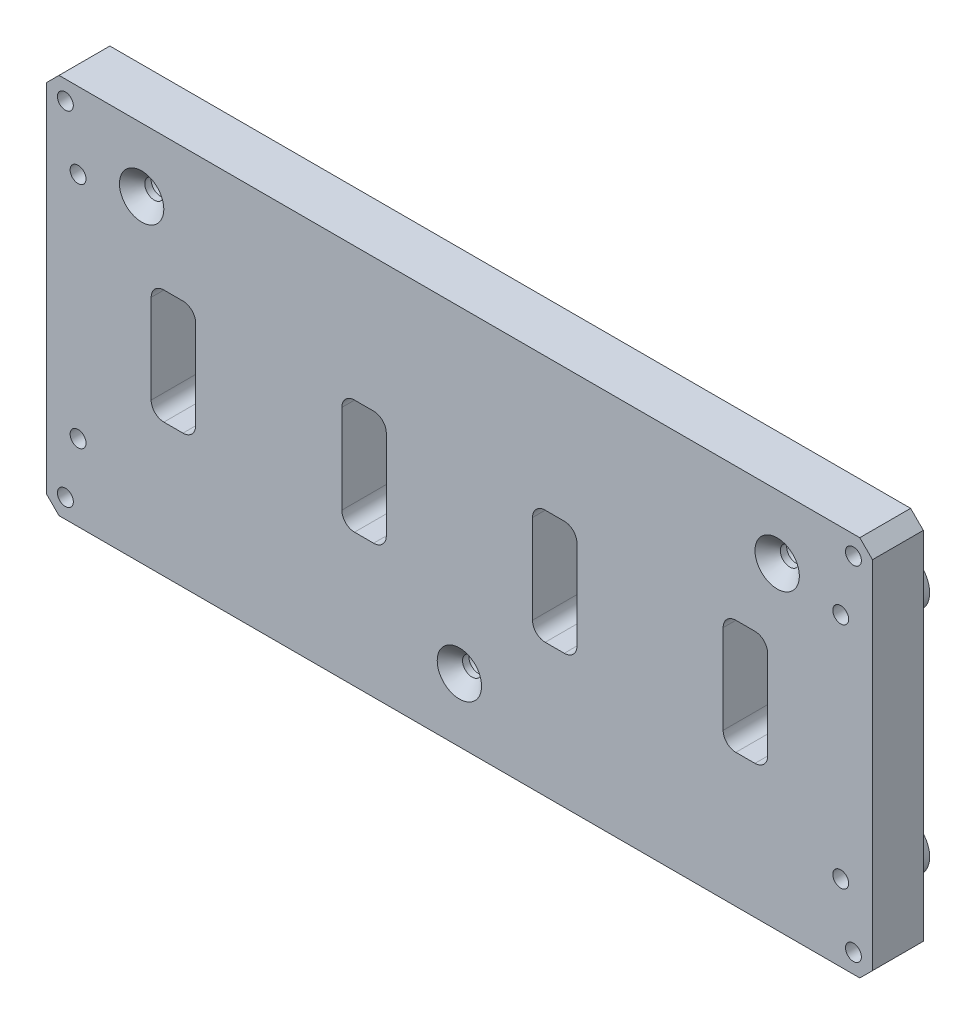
ISO-10303-21;
HEADER;
FILE_DESCRIPTION(('STEP AP214'),'2;1');
FILE_NAME('part.step','',(''),(''),'','','');
FILE_SCHEMA(('AUTOMOTIVE_DESIGN { 1 0 10303 214 1 1 1 1 }'));
ENDSEC;
DATA;
#1=APPLICATION_CONTEXT('core data for automotive mechanical design processes');
#2=APPLICATION_PROTOCOL_DEFINITION('international standard','automotive_design',2000,#1);
#3=PRODUCT_CONTEXT('',#1,'mechanical');
#4=PRODUCT('Part','Part','',(#3));
#5=PRODUCT_RELATED_PRODUCT_CATEGORY('part','',(#4));
#6=PRODUCT_DEFINITION_FORMATION('','',#4);
#7=PRODUCT_DEFINITION_CONTEXT('part definition',#1,'design');
#8=PRODUCT_DEFINITION('design','',#6,#7);
#9=PRODUCT_DEFINITION_SHAPE('','',#8);
#10=(LENGTH_UNIT() NAMED_UNIT(*) SI_UNIT(.MILLI.,.METRE.));
#11=(NAMED_UNIT(*) PLANE_ANGLE_UNIT() SI_UNIT($,.RADIAN.));
#12=(NAMED_UNIT(*) SI_UNIT($,.STERADIAN.) SOLID_ANGLE_UNIT());
#13=UNCERTAINTY_MEASURE_WITH_UNIT(LENGTH_MEASURE(1.E-05),#10,'distance_accuracy_value','');
#14=(GEOMETRIC_REPRESENTATION_CONTEXT(3) GLOBAL_UNCERTAINTY_ASSIGNED_CONTEXT((#13)) GLOBAL_UNIT_ASSIGNED_CONTEXT((#10,
#11,#12)) REPRESENTATION_CONTEXT('',''));
#15=CARTESIAN_POINT('',(0.,0.,0.));
#16=DIRECTION('',(0.,0.,1.));
#17=DIRECTION('',(1.,0.,0.));
#18=AXIS2_PLACEMENT_3D('',#15,#16,#17);
#19=CARTESIAN_POINT('',(-64.9999999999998,-30.,-22.));
#20=DIRECTION('',(-1.,0.,0.));
#21=DIRECTION('',(0.,0.,1.));
#22=AXIS2_PLACEMENT_3D('',#19,#20,#21);
#23=PLANE('',#22);
#24=DIRECTION('',(0.,1.,0.));
#25=VECTOR('',#24,1.);
#26=CARTESIAN_POINT('',(-64.9999999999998,-30.,-22.));
#27=LINE('',#26,#25);
#28=CARTESIAN_POINT('',(-64.9999999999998,-28.,-22.));
#29=VERTEX_POINT('',#28);
#30=CARTESIAN_POINT('',(-65.,28.,-22.));
#31=VERTEX_POINT('',#30);
#32=EDGE_CURVE('E663',#29,#31,#27,.T.);
#33=ORIENTED_EDGE('',*,*,#32,.T.);
#34=DIRECTION('',(0.,0.,-1.));
#35=VECTOR('',#34,1.);
#36=CARTESIAN_POINT('',(-65.,28.,-22.));
#37=LINE('',#36,#35);
#38=CARTESIAN_POINT('',(-65.0000000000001,27.9999999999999,-30.));
#39=VERTEX_POINT('',#38);
#40=EDGE_CURVE('E11',#31,#39,#37,.T.);
#41=ORIENTED_EDGE('',*,*,#40,.T.);
#42=DIRECTION('',(0.,-1.,0.));
#43=VECTOR('',#42,1.);
#44=CARTESIAN_POINT('',(-65.,-30.0000000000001,-30.));
#45=LINE('',#44,#43);
#46=CARTESIAN_POINT('',(-65.,-28.0000000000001,-30.));
#47=VERTEX_POINT('',#46);
#48=EDGE_CURVE('E639',#39,#47,#45,.T.);
#49=ORIENTED_EDGE('',*,*,#48,.T.);
#50=DIRECTION('',(0.,0.,1.));
#51=VECTOR('',#50,1.);
#52=CARTESIAN_POINT('',(-64.9999999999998,-28.,-22.));
#53=LINE('',#52,#51);
#54=EDGE_CURVE('E42',#47,#29,#53,.T.);
#55=ORIENTED_EDGE('',*,*,#54,.T.);
#56=EDGE_LOOP('',(#33,#41,#49,#55));
#57=FACE_BOUND('',#56,.T.);
#58=ADVANCED_FACE('F34',(#57),#23,.T.);
#59=CARTESIAN_POINT('',(-64.9999999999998,-30.,-22.));
#60=DIRECTION('',(0.,-1.,0.));
#61=DIRECTION('',(1.,0.,0.));
#62=AXIS2_PLACEMENT_3D('',#59,#60,#61);
#63=PLANE('',#62);
#64=DIRECTION('',(1.,0.,0.));
#65=VECTOR('',#64,1.);
#66=CARTESIAN_POINT('',(-65.,-30.0000000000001,-30.));
#67=LINE('',#66,#65);
#68=CARTESIAN_POINT('',(-63.,-30.0000000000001,-30.));
#69=VERTEX_POINT('',#68);
#70=CARTESIAN_POINT('',(62.9999999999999,-30.,-30.));
#71=VERTEX_POINT('',#70);
#72=EDGE_CURVE('E636',#69,#71,#67,.T.);
#73=ORIENTED_EDGE('',*,*,#72,.T.);
#74=DIRECTION('',(0.,0.,1.));
#75=VECTOR('',#74,1.);
#76=CARTESIAN_POINT('',(62.9999999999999,-30.,-22.));
#77=LINE('',#76,#75);
#78=CARTESIAN_POINT('',(62.9999999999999,-30.,-22.));
#79=VERTEX_POINT('',#78);
#80=EDGE_CURVE('E717',#71,#79,#77,.T.);
#81=ORIENTED_EDGE('',*,*,#80,.T.);
#82=DIRECTION('',(-1.,0.,0.));
#83=VECTOR('',#82,1.);
#84=CARTESIAN_POINT('',(-64.9999999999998,-30.,-22.));
#85=LINE('',#84,#83);
#86=CARTESIAN_POINT('',(-62.9999999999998,-30.0000000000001,-22.));
#87=VERTEX_POINT('',#86);
#88=EDGE_CURVE('E672',#79,#87,#85,.T.);
#89=ORIENTED_EDGE('',*,*,#88,.T.);
#90=DIRECTION('',(0.,0.,-1.));
#91=VECTOR('',#90,1.);
#92=CARTESIAN_POINT('',(-62.9999999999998,-30.0000000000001,-22.));
#93=LINE('',#92,#91);
#94=EDGE_CURVE('E714',#87,#69,#93,.T.);
#95=ORIENTED_EDGE('',*,*,#94,.T.);
#96=EDGE_LOOP('',(#73,#81,#89,#95));
#97=FACE_BOUND('',#96,.T.);
#98=ADVANCED_FACE('F734',(#97),#63,.T.);
#99=CARTESIAN_POINT('',(64.9999999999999,-30.,-22.));
#100=DIRECTION('',(1.,0.,0.));
#101=DIRECTION('',(0.,1.,0.));
#102=AXIS2_PLACEMENT_3D('',#99,#100,#101);
#103=PLANE('',#102);
#104=DIRECTION('',(0.,1.,0.));
#105=VECTOR('',#104,1.);
#106=CARTESIAN_POINT('',(64.9999999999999,-30.,-30.));
#107=LINE('',#106,#105);
#108=CARTESIAN_POINT('',(64.9999999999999,-28.,-30.));
#109=VERTEX_POINT('',#108);
#110=CARTESIAN_POINT('',(64.9999999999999,28.,-30.0000000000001));
#111=VERTEX_POINT('',#110);
#112=EDGE_CURVE('E631',#109,#111,#107,.T.);
#113=ORIENTED_EDGE('',*,*,#112,.T.);
#114=DIRECTION('',(0.,0.,1.));
#115=VECTOR('',#114,1.);
#116=CARTESIAN_POINT('',(64.9999999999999,27.9999999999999,-22.0000000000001));
#117=LINE('',#116,#115);
#118=CARTESIAN_POINT('',(64.9999999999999,27.9999999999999,-22.0000000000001));
#119=VERTEX_POINT('',#118);
#120=EDGE_CURVE('E704',#111,#119,#117,.T.);
#121=ORIENTED_EDGE('',*,*,#120,.T.);
#122=DIRECTION('',(0.,-1.,0.));
#123=VECTOR('',#122,1.);
#124=CARTESIAN_POINT('',(64.9999999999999,-30.,-22.));
#125=LINE('',#124,#123);
#126=CARTESIAN_POINT('',(64.9999999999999,-28.,-22.));
#127=VERTEX_POINT('',#126);
#128=EDGE_CURVE('E669',#119,#127,#125,.T.);
#129=ORIENTED_EDGE('',*,*,#128,.T.);
#130=DIRECTION('',(0.,0.,-1.));
#131=VECTOR('',#130,1.);
#132=CARTESIAN_POINT('',(64.9999999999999,-28.,-22.));
#133=LINE('',#132,#131);
#134=EDGE_CURVE('E701',#127,#109,#133,.T.);
#135=ORIENTED_EDGE('',*,*,#134,.T.);
#136=EDGE_LOOP('',(#113,#121,#129,#135));
#137=FACE_BOUND('',#136,.T.);
#138=ADVANCED_FACE('F745',(#137),#103,.T.);
#139=CARTESIAN_POINT('',(-64.9999999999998,30.,-22.0000000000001));
#140=DIRECTION('',(0.,1.,0.));
#141=DIRECTION('',(-1.,0.,0.));
#142=AXIS2_PLACEMENT_3D('',#139,#140,#141);
#143=PLANE('',#142);
#144=DIRECTION('',(1.,0.,0.));
#145=VECTOR('',#144,1.);
#146=CARTESIAN_POINT('',(-64.9999999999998,30.,-22.0000000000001));
#147=LINE('',#146,#145);
#148=CARTESIAN_POINT('',(-62.9999999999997,29.9999999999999,-22.0000000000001));
#149=VERTEX_POINT('',#148);
#150=CARTESIAN_POINT('',(62.9999999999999,29.9999999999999,-22.0000000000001));
#151=VERTEX_POINT('',#150);
#152=EDGE_CURVE('E666',#149,#151,#147,.T.);
#153=ORIENTED_EDGE('',*,*,#152,.T.);
#154=DIRECTION('',(0.,0.,-1.));
#155=VECTOR('',#154,1.);
#156=CARTESIAN_POINT('',(62.9999999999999,29.9999999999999,-22.0000000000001));
#157=LINE('',#156,#155);
#158=CARTESIAN_POINT('',(62.9999999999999,30.,-30.0000000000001));
#159=VERTEX_POINT('',#158);
#160=EDGE_CURVE('E690',#151,#159,#157,.T.);
#161=ORIENTED_EDGE('',*,*,#160,.T.);
#162=DIRECTION('',(-1.,0.,0.));
#163=VECTOR('',#162,1.);
#164=CARTESIAN_POINT('',(-65.,29.9999999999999,-30.0000000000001));
#165=LINE('',#164,#163);
#166=CARTESIAN_POINT('',(-63.,29.9999999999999,-30.0000000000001));
#167=VERTEX_POINT('',#166);
#168=EDGE_CURVE('E675',#159,#167,#165,.T.);
#169=ORIENTED_EDGE('',*,*,#168,.T.);
#170=DIRECTION('',(0.,0.,1.));
#171=VECTOR('',#170,1.);
#172=CARTESIAN_POINT('',(-62.9999999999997,29.9999999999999,-22.0000000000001));
#173=LINE('',#172,#171);
#174=EDGE_CURVE('E684',#167,#149,#173,.T.);
#175=ORIENTED_EDGE('',*,*,#174,.T.);
#176=EDGE_LOOP('',(#153,#161,#169,#175));
#177=FACE_BOUND('',#176,.T.);
#178=ADVANCED_FACE('F752',(#177),#143,.T.);
#179=CARTESIAN_POINT('',(4.9960036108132E-13,0.,-22.));
#180=DIRECTION('',(0.,0.,-1.));
#181=DIRECTION('',(-1.,0.,0.));
#182=AXIS2_PLACEMENT_3D('',#179,#180,#181);
#183=PLANE('',#182);
#184=DIRECTION('',(0.,1.,0.));
#185=VECTOR('',#184,1.);
#186=CARTESIAN_POINT('',(-48.4999999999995,-1.11022302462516E-13,-22.0000000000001));
#187=LINE('',#186,#185);
#188=CARTESIAN_POINT('',(-48.4999999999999,-7.00000000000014,-22.));
#189=VERTEX_POINT('',#188);
#190=CARTESIAN_POINT('',(-48.5,6.99999999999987,-22.0000000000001));
#191=VERTEX_POINT('',#190);
#192=EDGE_CURVE('E559',#189,#191,#187,.T.);
#193=ORIENTED_EDGE('',*,*,#192,.T.);
#194=CARTESIAN_POINT('',(-46.4999999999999,6.99999999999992,-22.0000000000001));
#195=DIRECTION('',(0.,0.,-1.));
#196=DIRECTION('',(-1.,0.,0.));
#197=AXIS2_PLACEMENT_3D('',#194,#195,#196);
#198=CIRCLE('',#197,2.00000000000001);
#199=CARTESIAN_POINT('',(-46.4999999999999,8.99999999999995,-22.));
#200=VERTEX_POINT('',#199);
#201=EDGE_CURVE('E562',#191,#200,#198,.T.);
#202=ORIENTED_EDGE('',*,*,#201,.T.);
#203=DIRECTION('',(1.,0.,0.));
#204=VECTOR('',#203,1.);
#205=CARTESIAN_POINT('',(0.,8.99999999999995,-22.));
#206=LINE('',#205,#204);
#207=CARTESIAN_POINT('',(-43.4999999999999,8.99999999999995,-22.));
#208=VERTEX_POINT('',#207);
#209=EDGE_CURVE('E541',#200,#208,#206,.T.);
#210=ORIENTED_EDGE('',*,*,#209,.T.);
#211=CARTESIAN_POINT('',(-43.4999999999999,6.99999999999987,-22.0000000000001));
#212=DIRECTION('',(0.,0.,-1.));
#213=DIRECTION('',(-1.,0.,0.));
#214=AXIS2_PLACEMENT_3D('',#211,#212,#213);
#215=CIRCLE('',#214,2.);
#216=CARTESIAN_POINT('',(-41.4999999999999,6.99999999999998,-22.));
#217=VERTEX_POINT('',#216);
#218=EDGE_CURVE('E544',#208,#217,#215,.T.);
#219=ORIENTED_EDGE('',*,*,#218,.T.);
#220=DIRECTION('',(0.,-1.,0.));
#221=VECTOR('',#220,1.);
#222=CARTESIAN_POINT('',(-41.4999999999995,0.,-22.));
#223=LINE('',#222,#221);
#224=CARTESIAN_POINT('',(-41.4999999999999,-7.00000000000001,-22.));
#225=VERTEX_POINT('',#224);
#226=EDGE_CURVE('E547',#217,#225,#223,.T.);
#227=ORIENTED_EDGE('',*,*,#226,.T.);
#228=CARTESIAN_POINT('',(-43.4999999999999,-7.00000000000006,-22.));
#229=DIRECTION('',(0.,0.,-1.));
#230=DIRECTION('',(-1.,0.,0.));
#231=AXIS2_PLACEMENT_3D('',#228,#229,#230);
#232=CIRCLE('',#231,2.);
#233=CARTESIAN_POINT('',(-43.4999999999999,-9.00000000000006,-22.));
#234=VERTEX_POINT('',#233);
#235=EDGE_CURVE('E550',#225,#234,#232,.T.);
#236=ORIENTED_EDGE('',*,*,#235,.T.);
#237=DIRECTION('',(-1.,0.,0.));
#238=VECTOR('',#237,1.);
#239=CARTESIAN_POINT('',(0.,-9.00000000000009,-22.));
#240=LINE('',#239,#238);
#241=CARTESIAN_POINT('',(-46.4999999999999,-9.00000000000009,-22.));
#242=VERTEX_POINT('',#241);
#243=EDGE_CURVE('E553',#234,#242,#240,.T.);
#244=ORIENTED_EDGE('',*,*,#243,.T.);
#245=CARTESIAN_POINT('',(-46.4999999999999,-7.00000000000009,-22.));
#246=DIRECTION('',(0.,0.,-1.));
#247=DIRECTION('',(-1.,0.,0.));
#248=AXIS2_PLACEMENT_3D('',#245,#246,#247);
#249=CIRCLE('',#248,2.);
#250=EDGE_CURVE('E556',#242,#189,#249,.T.);
#251=ORIENTED_EDGE('',*,*,#250,.T.);
#252=EDGE_LOOP('',(#193,#202,#210,#219,#227,#236,#244,#251));
#253=FACE_BOUND('',#252,.T.);
#254=DIRECTION('',(0.,1.,0.));
#255=VECTOR('',#254,1.);
#256=CARTESIAN_POINT('',(11.5000000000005,0.,-22.0000000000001));
#257=LINE('',#256,#255);
#258=CARTESIAN_POINT('',(11.5000000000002,-6.99999999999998,-22.));
#259=VERTEX_POINT('',#258);
#260=CARTESIAN_POINT('',(11.5000000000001,7.00000000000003,-22.0000000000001));
#261=VERTEX_POINT('',#260);
#262=EDGE_CURVE('E535',#259,#261,#257,.T.);
#263=ORIENTED_EDGE('',*,*,#262,.T.);
#264=CARTESIAN_POINT('',(13.5000000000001,6.9999999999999,-22.0000000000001));
#265=DIRECTION('',(0.,0.,-1.));
#266=DIRECTION('',(-1.,0.,0.));
#267=AXIS2_PLACEMENT_3D('',#264,#265,#266);
#268=CIRCLE('',#267,2.);
#269=CARTESIAN_POINT('',(13.5,8.9999999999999,-22.));
#270=VERTEX_POINT('',#269);
#271=EDGE_CURVE('E538',#261,#270,#268,.T.);
#272=ORIENTED_EDGE('',*,*,#271,.T.);
#273=DIRECTION('',(1.,0.,0.));
#274=VECTOR('',#273,1.);
#275=CARTESIAN_POINT('',(0.,8.99999999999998,-22.));
#276=LINE('',#275,#274);
#277=CARTESIAN_POINT('',(16.5,8.9999999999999,-22.0000000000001));
#278=VERTEX_POINT('',#277);
#279=EDGE_CURVE('E517',#270,#278,#276,.T.);
#280=ORIENTED_EDGE('',*,*,#279,.T.);
#281=CARTESIAN_POINT('',(16.5,6.9999999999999,-22.0000000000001));
#282=DIRECTION('',(0.,0.,-1.));
#283=DIRECTION('',(-1.,0.,0.));
#284=AXIS2_PLACEMENT_3D('',#281,#282,#283);
#285=CIRCLE('',#284,2.);
#286=CARTESIAN_POINT('',(18.5,7.00000000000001,-22.));
#287=VERTEX_POINT('',#286);
#288=EDGE_CURVE('E520',#278,#287,#285,.T.);
#289=ORIENTED_EDGE('',*,*,#288,.T.);
#290=DIRECTION('',(0.,-1.,0.));
#291=VECTOR('',#290,1.);
#292=CARTESIAN_POINT('',(18.5000000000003,0.,-22.));
#293=LINE('',#292,#291);
#294=CARTESIAN_POINT('',(18.5000000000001,-6.99999999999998,-22.));
#295=VERTEX_POINT('',#294);
#296=EDGE_CURVE('E523',#287,#295,#293,.T.);
#297=ORIENTED_EDGE('',*,*,#296,.T.);
#298=CARTESIAN_POINT('',(16.5000000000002,-7.00000000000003,-22.));
#299=DIRECTION('',(0.,0.,-1.));
#300=DIRECTION('',(-1.,0.,0.));
#301=AXIS2_PLACEMENT_3D('',#298,#299,#300);
#302=CIRCLE('',#301,2.);
#303=CARTESIAN_POINT('',(16.5000000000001,-9.00000000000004,-22.));
#304=VERTEX_POINT('',#303);
#305=EDGE_CURVE('E526',#295,#304,#302,.T.);
#306=ORIENTED_EDGE('',*,*,#305,.T.);
#307=DIRECTION('',(-1.,0.,0.));
#308=VECTOR('',#307,1.);
#309=CARTESIAN_POINT('',(0.,-9.00000000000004,-22.));
#310=LINE('',#309,#308);
#311=CARTESIAN_POINT('',(13.5000000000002,-9.00000000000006,-22.));
#312=VERTEX_POINT('',#311);
#313=EDGE_CURVE('E529',#304,#312,#310,.T.);
#314=ORIENTED_EDGE('',*,*,#313,.T.);
#315=CARTESIAN_POINT('',(13.5000000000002,-7.00000000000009,-22.));
#316=DIRECTION('',(0.,0.,-1.));
#317=DIRECTION('',(-1.,0.,0.));
#318=AXIS2_PLACEMENT_3D('',#315,#316,#317);
#319=CIRCLE('',#318,2.);
#320=EDGE_CURVE('E532',#312,#259,#319,.T.);
#321=ORIENTED_EDGE('',*,*,#320,.T.);
#322=EDGE_LOOP('',(#263,#272,#280,#289,#297,#306,#314,#321));
#323=FACE_BOUND('',#322,.T.);
#324=DIRECTION('',(0.,-1.,0.));
#325=VECTOR('',#324,1.);
#326=CARTESIAN_POINT('',(48.4999999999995,0.,-22.0000000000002));
#327=LINE('',#326,#325);
#328=CARTESIAN_POINT('',(48.4999999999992,6.9999999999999,-22.0000000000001));
#329=VERTEX_POINT('',#328);
#330=CARTESIAN_POINT('',(48.4999999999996,-7.00000000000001,-22.));
#331=VERTEX_POINT('',#330);
#332=EDGE_CURVE('E511',#329,#331,#327,.T.);
#333=ORIENTED_EDGE('',*,*,#332,.T.);
#334=CARTESIAN_POINT('',(46.4999999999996,-7.00000000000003,-22.));
#335=DIRECTION('',(0.,0.,-1.));
#336=DIRECTION('',(-1.,0.,0.));
#337=AXIS2_PLACEMENT_3D('',#334,#335,#336);
#338=CIRCLE('',#337,2.00000000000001);
#339=CARTESIAN_POINT('',(46.4999999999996,-9.00000000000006,-22.));
#340=VERTEX_POINT('',#339);
#341=EDGE_CURVE('E514',#331,#340,#338,.T.);
#342=ORIENTED_EDGE('',*,*,#341,.T.);
#343=DIRECTION('',(-1.,0.,0.));
#344=VECTOR('',#343,1.);
#345=CARTESIAN_POINT('',(0.,-9.00000000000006,-22.));
#346=LINE('',#345,#344);
#347=CARTESIAN_POINT('',(43.4999999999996,-9.00000000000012,-22.0000000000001));
#348=VERTEX_POINT('',#347);
#349=EDGE_CURVE('E496',#340,#348,#346,.T.);
#350=ORIENTED_EDGE('',*,*,#349,.T.);
#351=CARTESIAN_POINT('',(43.4999999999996,-7.00000000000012,-22.));
#352=DIRECTION('',(0.,0.,-1.));
#353=DIRECTION('',(-1.,0.,0.));
#354=AXIS2_PLACEMENT_3D('',#351,#352,#353);
#355=CIRCLE('',#354,2.);
#356=CARTESIAN_POINT('',(41.4999999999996,-7.00000000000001,-22.));
#357=VERTEX_POINT('',#356);
#358=EDGE_CURVE('E308',#348,#357,#355,.T.);
#359=ORIENTED_EDGE('',*,*,#358,.T.);
#360=DIRECTION('',(0.,1.,0.));
#361=VECTOR('',#360,1.);
#362=CARTESIAN_POINT('',(41.4999999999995,0.,-22.));
#363=LINE('',#362,#361);
#364=CARTESIAN_POINT('',(41.4999999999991,7.00000000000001,-22.));
#365=VERTEX_POINT('',#364);
#366=EDGE_CURVE('E499',#357,#365,#363,.T.);
#367=ORIENTED_EDGE('',*,*,#366,.T.);
#368=CARTESIAN_POINT('',(43.4999999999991,6.9999999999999,-22.0000000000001));
#369=DIRECTION('',(0.,0.,-1.));
#370=DIRECTION('',(-1.,0.,0.));
#371=AXIS2_PLACEMENT_3D('',#368,#369,#370);
#372=CIRCLE('',#371,2.);
#373=CARTESIAN_POINT('',(43.5000000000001,8.9999999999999,-22.));
#374=VERTEX_POINT('',#373);
#375=EDGE_CURVE('E502',#365,#374,#372,.T.);
#376=ORIENTED_EDGE('',*,*,#375,.T.);
#377=DIRECTION('',(1.,0.,0.));
#378=VECTOR('',#377,1.);
#379=CARTESIAN_POINT('',(0.,8.99999999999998,-22.));
#380=LINE('',#379,#378);
#381=CARTESIAN_POINT('',(46.5,8.99999999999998,-22.));
#382=VERTEX_POINT('',#381);
#383=EDGE_CURVE('E505',#374,#382,#380,.T.);
#384=ORIENTED_EDGE('',*,*,#383,.T.);
#385=CARTESIAN_POINT('',(46.4999999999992,6.99999999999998,-22.0000000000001));
#386=DIRECTION('',(0.,0.,-1.));
#387=DIRECTION('',(-1.,0.,0.));
#388=AXIS2_PLACEMENT_3D('',#385,#386,#387);
#389=CIRCLE('',#388,2.00000000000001);
#390=EDGE_CURVE('E508',#382,#329,#389,.T.);
#391=ORIENTED_EDGE('',*,*,#390,.T.);
#392=EDGE_LOOP('',(#333,#342,#350,#359,#367,#376,#384,#391));
#393=FACE_BOUND('',#392,.T.);
#394=DIRECTION('',(0.,1.,0.));
#395=VECTOR('',#394,1.);
#396=CARTESIAN_POINT('',(-18.4999999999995,0.,-22.));
#397=LINE('',#396,#395);
#398=CARTESIAN_POINT('',(-18.4999999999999,-7.00000000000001,-22.0000000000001));
#399=VERTEX_POINT('',#398);
#400=CARTESIAN_POINT('',(-18.5,7.00000000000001,-22.));
#401=VERTEX_POINT('',#400);
#402=EDGE_CURVE('E490',#399,#401,#397,.T.);
#403=ORIENTED_EDGE('',*,*,#402,.T.);
#404=CARTESIAN_POINT('',(-16.5,6.99999999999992,-22.));
#405=DIRECTION('',(0.,0.,-1.));
#406=DIRECTION('',(-1.,0.,0.));
#407=AXIS2_PLACEMENT_3D('',#404,#405,#406);
#408=CIRCLE('',#407,2.);
#409=CARTESIAN_POINT('',(-16.5,8.99999999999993,-21.9999999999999));
#410=VERTEX_POINT('',#409);
#411=EDGE_CURVE('E493',#401,#410,#408,.T.);
#412=ORIENTED_EDGE('',*,*,#411,.T.);
#413=DIRECTION('',(1.,0.,0.));
#414=VECTOR('',#413,1.);
#415=CARTESIAN_POINT('',(0.,8.99999999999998,-22.));
#416=LINE('',#415,#414);
#417=CARTESIAN_POINT('',(-13.5,8.9999999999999,-22.));
#418=VERTEX_POINT('',#417);
#419=EDGE_CURVE('E458',#410,#418,#416,.T.);
#420=ORIENTED_EDGE('',*,*,#419,.T.);
#421=CARTESIAN_POINT('',(-13.4999999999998,6.9999999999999,-22.0000000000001));
#422=DIRECTION('',(0.,0.,-1.));
#423=DIRECTION('',(-1.,0.,0.));
#424=AXIS2_PLACEMENT_3D('',#421,#422,#423);
#425=CIRCLE('',#424,2.);
#426=CARTESIAN_POINT('',(-11.4999999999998,7.00000000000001,-22.0000000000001));
#427=VERTEX_POINT('',#426);
#428=EDGE_CURVE('E475',#418,#427,#425,.T.);
#429=ORIENTED_EDGE('',*,*,#428,.T.);
#430=DIRECTION('',(0.,-1.,0.));
#431=VECTOR('',#430,1.);
#432=CARTESIAN_POINT('',(-11.4999999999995,0.,-22.0000000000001));
#433=LINE('',#432,#431);
#434=CARTESIAN_POINT('',(-11.4999999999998,-6.99999999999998,-22.));
#435=VERTEX_POINT('',#434);
#436=EDGE_CURVE('E478',#427,#435,#433,.T.);
#437=ORIENTED_EDGE('',*,*,#436,.T.);
#438=CARTESIAN_POINT('',(-13.4999999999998,-7.00000000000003,-22.0000000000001));
#439=DIRECTION('',(0.,0.,-1.));
#440=DIRECTION('',(-1.,0.,0.));
#441=AXIS2_PLACEMENT_3D('',#438,#439,#440);
#442=CIRCLE('',#441,2.);
#443=CARTESIAN_POINT('',(-13.4999999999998,-9.00000000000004,-22.));
#444=VERTEX_POINT('',#443);
#445=EDGE_CURVE('E481',#435,#444,#442,.T.);
#446=ORIENTED_EDGE('',*,*,#445,.T.);
#447=DIRECTION('',(-1.,0.,0.));
#448=VECTOR('',#447,1.);
#449=CARTESIAN_POINT('',(0.,-9.00000000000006,-22.));
#450=LINE('',#449,#448);
#451=CARTESIAN_POINT('',(-16.4999999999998,-9.00000000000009,-22.));
#452=VERTEX_POINT('',#451);
#453=EDGE_CURVE('E484',#444,#452,#450,.T.);
#454=ORIENTED_EDGE('',*,*,#453,.T.);
#455=CARTESIAN_POINT('',(-16.4999999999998,-7.00000000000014,-22.0000000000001));
#456=DIRECTION('',(0.,0.,-1.));
#457=DIRECTION('',(-1.,0.,0.));
#458=AXIS2_PLACEMENT_3D('',#455,#456,#457);
#459=CIRCLE('',#458,2.);
#460=EDGE_CURVE('E487',#452,#399,#459,.T.);
#461=ORIENTED_EDGE('',*,*,#460,.T.);
#462=EDGE_LOOP('',(#403,#412,#420,#429,#437,#446,#454,#461));
#463=FACE_BOUND('',#462,.T.);
#464=CARTESIAN_POINT('',(-61.9999999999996,27.,-22.));
#465=DIRECTION('',(0.,0.,1.));
#466=DIRECTION('',(1.,0.,0.));
#467=AXIS2_PLACEMENT_3D('',#464,#465,#466);
#468=CIRCLE('',#467,1.24999999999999);
#469=CARTESIAN_POINT('',(-60.7499999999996,27.,-22.));
#470=VERTEX_POINT('',#469);
#471=EDGE_CURVE('E565',#470,#470,#468,.T.);
#472=ORIENTED_EDGE('',*,*,#471,.F.);
#473=EDGE_LOOP('',(#472));
#474=FACE_BOUND('',#473,.T.);
#475=CARTESIAN_POINT('',(-61.9999999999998,-27.0000000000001,-22.));
#476=DIRECTION('',(0.,0.,1.));
#477=DIRECTION('',(1.,0.,0.));
#478=AXIS2_PLACEMENT_3D('',#475,#476,#477);
#479=CIRCLE('',#478,1.24999999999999);
#480=CARTESIAN_POINT('',(-60.7499999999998,-27.0000000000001,-22.));
#481=VERTEX_POINT('',#480);
#482=EDGE_CURVE('E571',#481,#481,#479,.T.);
#483=ORIENTED_EDGE('',*,*,#482,.F.);
#484=EDGE_LOOP('',(#483));
#485=FACE_BOUND('',#484,.T.);
#486=CARTESIAN_POINT('',(61.9999999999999,-27.0000000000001,-21.9999999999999));
#487=DIRECTION('',(0.,0.,1.));
#488=DIRECTION('',(1.,0.,0.));
#489=AXIS2_PLACEMENT_3D('',#486,#487,#488);
#490=CIRCLE('',#489,1.24999999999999);
#491=CARTESIAN_POINT('',(63.2499999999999,-27.0000000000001,-21.9999999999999));
#492=VERTEX_POINT('',#491);
#493=EDGE_CURVE('E577',#492,#492,#490,.T.);
#494=ORIENTED_EDGE('',*,*,#493,.F.);
#495=EDGE_LOOP('',(#494));
#496=FACE_BOUND('',#495,.T.);
#497=CARTESIAN_POINT('',(61.9999999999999,27.,-21.9999999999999));
#498=DIRECTION('',(0.,0.,1.));
#499=DIRECTION('',(1.,0.,0.));
#500=AXIS2_PLACEMENT_3D('',#497,#498,#499);
#501=CIRCLE('',#500,1.24999999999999);
#502=CARTESIAN_POINT('',(63.2499999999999,27.,-21.9999999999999));
#503=VERTEX_POINT('',#502);
#504=EDGE_CURVE('E583',#503,#503,#501,.T.);
#505=ORIENTED_EDGE('',*,*,#504,.F.);
#506=EDGE_LOOP('',(#505));
#507=FACE_BOUND('',#506,.T.);
#508=CARTESIAN_POINT('',(60.,17.9999999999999,-22.));
#509=DIRECTION('',(0.,0.,-1.));
#510=DIRECTION('',(-1.,0.,0.));
#511=AXIS2_PLACEMENT_3D('',#508,#509,#510);
#512=CIRCLE('',#511,1.25);
#513=CARTESIAN_POINT('',(58.75,17.9999999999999,-22.));
#514=VERTEX_POINT('',#513);
#515=EDGE_CURVE('E590',#514,#514,#512,.T.);
#516=ORIENTED_EDGE('',*,*,#515,.T.);
#517=EDGE_LOOP('',(#516));
#518=FACE_BOUND('',#517,.T.);
#519=CARTESIAN_POINT('',(59.9999999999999,-18.0000000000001,-22.));
#520=DIRECTION('',(0.,0.,-1.));
#521=DIRECTION('',(-1.,0.,0.));
#522=AXIS2_PLACEMENT_3D('',#519,#520,#521);
#523=CIRCLE('',#522,1.25);
#524=CARTESIAN_POINT('',(58.7499999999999,-18.0000000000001,-22.));
#525=VERTEX_POINT('',#524);
#526=EDGE_CURVE('E596',#525,#525,#523,.T.);
#527=ORIENTED_EDGE('',*,*,#526,.T.);
#528=EDGE_LOOP('',(#527));
#529=FACE_BOUND('',#528,.T.);
#530=CARTESIAN_POINT('',(-60.,17.9999999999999,-22.));
#531=DIRECTION('',(0.,0.,-1.));
#532=DIRECTION('',(-1.,0.,0.));
#533=AXIS2_PLACEMENT_3D('',#530,#531,#532);
#534=CIRCLE('',#533,1.25);
#535=CARTESIAN_POINT('',(-61.25,17.9999999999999,-22.));
#536=VERTEX_POINT('',#535);
#537=EDGE_CURVE('E602',#536,#536,#534,.T.);
#538=ORIENTED_EDGE('',*,*,#537,.T.);
#539=EDGE_LOOP('',(#538));
#540=FACE_BOUND('',#539,.T.);
#541=CARTESIAN_POINT('',(-60.,-18.,-22.));
#542=DIRECTION('',(0.,0.,-1.));
#543=DIRECTION('',(-1.,0.,0.));
#544=AXIS2_PLACEMENT_3D('',#541,#542,#543);
#545=CIRCLE('',#544,1.25);
#546=CARTESIAN_POINT('',(-61.25,-18.,-22.));
#547=VERTEX_POINT('',#546);
#548=EDGE_CURVE('E608',#547,#547,#545,.T.);
#549=ORIENTED_EDGE('',*,*,#548,.T.);
#550=EDGE_LOOP('',(#549));
#551=FACE_BOUND('',#550,.T.);
#552=CARTESIAN_POINT('',(50.,20.,-22.0000000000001));
#553=DIRECTION('',(0.,0.,-1.));
#554=DIRECTION('',(-1.,0.,0.));
#555=AXIS2_PLACEMENT_3D('',#552,#553,#554);
#556=CIRCLE('',#555,3.49012806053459);
#557=CARTESIAN_POINT('',(46.5098719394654,20.,-22.0000000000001));
#558=VERTEX_POINT('',#557);
#559=EDGE_CURVE('E648',#558,#558,#556,.T.);
#560=ORIENTED_EDGE('',*,*,#559,.T.);
#561=EDGE_LOOP('',(#560));
#562=FACE_BOUND('',#561,.T.);
#563=CARTESIAN_POINT('',(0.,-20.0000000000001,-22.));
#564=DIRECTION('',(0.,0.,-1.));
#565=DIRECTION('',(-1.,0.,0.));
#566=AXIS2_PLACEMENT_3D('',#563,#564,#565);
#567=CIRCLE('',#566,3.49012806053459);
#568=CARTESIAN_POINT('',(-3.49012806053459,-20.0000000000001,-22.));
#569=VERTEX_POINT('',#568);
#570=EDGE_CURVE('E655',#569,#569,#567,.T.);
#571=ORIENTED_EDGE('',*,*,#570,.T.);
#572=EDGE_LOOP('',(#571));
#573=FACE_BOUND('',#572,.T.);
#574=CARTESIAN_POINT('',(-50.,20.,-22.0000000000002));
#575=DIRECTION('',(0.,0.,-1.));
#576=DIRECTION('',(-1.,0.,0.));
#577=AXIS2_PLACEMENT_3D('',#574,#575,#576);
#578=CIRCLE('',#577,3.49012806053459);
#579=CARTESIAN_POINT('',(-53.4901280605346,20.,-22.0000000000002));
#580=VERTEX_POINT('',#579);
#581=EDGE_CURVE('E662',#580,#580,#578,.T.);
#582=ORIENTED_EDGE('',*,*,#581,.T.);
#583=EDGE_LOOP('',(#582));
#584=FACE_BOUND('',#583,.T.);
#585=ORIENTED_EDGE('',*,*,#128,.F.);
#586=DIRECTION('',(0.707106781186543,-0.707106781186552,0.));
#587=VECTOR('',#586,1.);
#588=CARTESIAN_POINT('',(62.9999999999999,29.9999999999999,-22.0000000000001));
#589=LINE('',#588,#587);
#590=EDGE_CURVE('E712',#119,#151,#589,.F.);
#591=ORIENTED_EDGE('',*,*,#590,.T.);
#592=ORIENTED_EDGE('',*,*,#152,.F.);
#593=DIRECTION('',(0.70710678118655,0.707106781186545,0.));
#594=VECTOR('',#593,1.);
#595=CARTESIAN_POINT('',(-65.,28.,-22.));
#596=LINE('',#595,#594);
#597=EDGE_CURVE('E708',#149,#31,#596,.F.);
#598=ORIENTED_EDGE('',*,*,#597,.T.);
#599=ORIENTED_EDGE('',*,*,#32,.F.);
#600=DIRECTION('',(-0.707106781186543,0.707106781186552,0.));
#601=VECTOR('',#600,1.);
#602=CARTESIAN_POINT('',(-62.9999999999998,-30.0000000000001,-22.));
#603=LINE('',#602,#601);
#604=EDGE_CURVE('E706',#29,#87,#603,.F.);
#605=ORIENTED_EDGE('',*,*,#604,.T.);
#606=ORIENTED_EDGE('',*,*,#88,.F.);
#607=DIRECTION('',(-0.70710678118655,-0.707106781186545,0.));
#608=VECTOR('',#607,1.);
#609=CARTESIAN_POINT('',(64.9999999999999,-28.,-22.));
#610=LINE('',#609,#608);
#611=EDGE_CURVE('E710',#79,#127,#610,.F.);
#612=ORIENTED_EDGE('',*,*,#611,.T.);
#613=EDGE_LOOP('',(#585,#591,#592,#598,#599,#605,#606,#612));
#614=FACE_BOUND('',#613,.T.);
#615=ADVANCED_FACE('F727',(#253,#323,#393,#463,#474,#485,#496,#507,#518,#529,#540,#551,#562,
#573,#584,#614),#183,.F.);
#616=CARTESIAN_POINT('',(-50.,19.9999999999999,-21.0000000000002));
#617=DIRECTION('',(0.,0.,1.));
#618=DIRECTION('',(1.,0.,0.));
#619=AXIS2_PLACEMENT_3D('',#616,#617,#618);
#620=CONICAL_SURFACE('',#619,4.49012806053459,0.785398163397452);
#621=CARTESIAN_POINT('',(-50.0000000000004,20.,-23.9901280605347));
#622=DIRECTION('',(0.,0.,1.));
#623=DIRECTION('',(1.,0.,0.));
#624=AXIS2_PLACEMENT_3D('',#621,#622,#623);
#625=CIRCLE('',#624,1.5);
#626=CARTESIAN_POINT('',(-48.5000000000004,20.,-23.9901280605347));
#627=VERTEX_POINT('',#626);
#628=EDGE_CURVE('E659',#627,#627,#625,.T.);
#629=ORIENTED_EDGE('',*,*,#628,.F.);
#630=EDGE_LOOP('',(#629));
#631=FACE_BOUND('',#630,.T.);
#632=ORIENTED_EDGE('',*,*,#581,.F.);
#633=EDGE_LOOP('',(#632));
#634=FACE_BOUND('',#633,.T.);
#635=ADVANCED_FACE('F865',(#631,#634),#620,.F.);
#636=CARTESIAN_POINT('',(-50.,20.,15.9648848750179));
#637=DIRECTION('',(0.,0.,1.));
#638=DIRECTION('',(1.,0.,0.));
#639=AXIS2_PLACEMENT_3D('',#636,#637,#638);
#640=CYLINDRICAL_SURFACE('',#639,1.5);
#641=CARTESIAN_POINT('',(-50.0000000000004,19.9999999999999,-25.0000000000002));
#642=DIRECTION('',(0.,0.,1.));
#643=DIRECTION('',(1.,0.,0.));
#644=AXIS2_PLACEMENT_3D('',#641,#642,#643);
#645=CIRCLE('',#644,1.50000000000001);
#646=CARTESIAN_POINT('',(-48.5000000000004,19.9999999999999,-25.0000000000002));
#647=VERTEX_POINT('',#646);
#648=EDGE_CURVE('E656',#647,#647,#645,.T.);
#649=ORIENTED_EDGE('',*,*,#648,.F.);
#650=EDGE_LOOP('',(#649));
#651=FACE_BOUND('',#650,.T.);
#652=ORIENTED_EDGE('',*,*,#628,.T.);
#653=EDGE_LOOP('',(#652));
#654=FACE_BOUND('',#653,.T.);
#655=ADVANCED_FACE('F861',(#651,#654),#640,.F.);
#656=CARTESIAN_POINT('',(-50.0000000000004,19.9999999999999,-25.0000000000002));
#657=DIRECTION('',(0.,0.,1.));
#658=DIRECTION('',(1.,0.,0.));
#659=AXIS2_PLACEMENT_3D('',#656,#657,#658);
#660=CONICAL_SURFACE('',#659,1.50000000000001,1.04719755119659);
#661=CARTESIAN_POINT('',(-50.0000000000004,19.9999999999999,-25.8660254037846));
#662=VERTEX_POINT('',#661);
#663=VERTEX_LOOP('',#662);
#664=FACE_BOUND('',#663,.T.);
#665=ORIENTED_EDGE('',*,*,#648,.T.);
#666=EDGE_LOOP('',(#665));
#667=FACE_BOUND('',#666,.T.);
#668=ADVANCED_FACE('F857',(#664,#667),#660,.F.);
#669=CARTESIAN_POINT('',(0.,-20.,-21.));
#670=DIRECTION('',(0.,0.,1.));
#671=DIRECTION('',(1.,0.,0.));
#672=AXIS2_PLACEMENT_3D('',#669,#670,#671);
#673=CONICAL_SURFACE('',#672,4.49012806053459,0.785398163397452);
#674=CARTESIAN_POINT('',(-4.44089209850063E-13,-20.,-23.9901280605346));
#675=DIRECTION('',(0.,0.,1.));
#676=DIRECTION('',(1.,0.,0.));
#677=AXIS2_PLACEMENT_3D('',#674,#675,#676);
#678=CIRCLE('',#677,1.5);
#679=CARTESIAN_POINT('',(1.49999999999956,-20.,-23.9901280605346));
#680=VERTEX_POINT('',#679);
#681=EDGE_CURVE('E652',#680,#680,#678,.T.);
#682=ORIENTED_EDGE('',*,*,#681,.F.);
#683=EDGE_LOOP('',(#682));
#684=FACE_BOUND('',#683,.T.);
#685=ORIENTED_EDGE('',*,*,#570,.F.);
#686=EDGE_LOOP('',(#685));
#687=FACE_BOUND('',#686,.T.);
#688=ADVANCED_FACE('F853',(#684,#687),#673,.F.);
#689=CARTESIAN_POINT('',(0.,-20.,15.964884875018));
#690=DIRECTION('',(0.,0.,1.));
#691=DIRECTION('',(1.,0.,0.));
#692=AXIS2_PLACEMENT_3D('',#689,#690,#691);
#693=CYLINDRICAL_SURFACE('',#692,1.5);
#694=CARTESIAN_POINT('',(-4.44089209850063E-13,-20.0000000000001,-25.));
#695=DIRECTION('',(0.,0.,1.));
#696=DIRECTION('',(1.,0.,0.));
#697=AXIS2_PLACEMENT_3D('',#694,#695,#696);
#698=CIRCLE('',#697,1.50000000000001);
#699=CARTESIAN_POINT('',(1.49999999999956,-20.0000000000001,-25.));
#700=VERTEX_POINT('',#699);
#701=EDGE_CURVE('E649',#700,#700,#698,.T.);
#702=ORIENTED_EDGE('',*,*,#701,.F.);
#703=EDGE_LOOP('',(#702));
#704=FACE_BOUND('',#703,.T.);
#705=ORIENTED_EDGE('',*,*,#681,.T.);
#706=EDGE_LOOP('',(#705));
#707=FACE_BOUND('',#706,.T.);
#708=ADVANCED_FACE('F849',(#704,#707),#693,.F.);
#709=CARTESIAN_POINT('',(-4.44089209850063E-13,-20.0000000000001,-25.));
#710=DIRECTION('',(0.,0.,1.));
#711=DIRECTION('',(1.,0.,0.));
#712=AXIS2_PLACEMENT_3D('',#709,#710,#711);
#713=CONICAL_SURFACE('',#712,1.50000000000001,1.04719755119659);
#714=CARTESIAN_POINT('',(-4.44089209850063E-13,-20.,-25.8660254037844));
#715=VERTEX_POINT('',#714);
#716=VERTEX_LOOP('',#715);
#717=FACE_BOUND('',#716,.T.);
#718=ORIENTED_EDGE('',*,*,#701,.T.);
#719=EDGE_LOOP('',(#718));
#720=FACE_BOUND('',#719,.T.);
#721=ADVANCED_FACE('F845',(#717,#720),#713,.F.);
#722=CARTESIAN_POINT('',(50.,19.9999999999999,-21.0000000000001));
#723=DIRECTION('',(0.,0.,1.));
#724=DIRECTION('',(1.,0.,0.));
#725=AXIS2_PLACEMENT_3D('',#722,#723,#724);
#726=CONICAL_SURFACE('',#725,4.49012806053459,0.785398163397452);
#727=CARTESIAN_POINT('',(50.,20.0000000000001,-23.9901280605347));
#728=DIRECTION('',(0.,0.,1.));
#729=DIRECTION('',(1.,0.,0.));
#730=AXIS2_PLACEMENT_3D('',#727,#728,#729);
#731=CIRCLE('',#730,1.5);
#732=CARTESIAN_POINT('',(51.5,20.0000000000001,-23.9901280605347));
#733=VERTEX_POINT('',#732);
#734=EDGE_CURVE('E645',#733,#733,#731,.T.);
#735=ORIENTED_EDGE('',*,*,#734,.F.);
#736=EDGE_LOOP('',(#735));
#737=FACE_BOUND('',#736,.T.);
#738=ORIENTED_EDGE('',*,*,#559,.F.);
#739=EDGE_LOOP('',(#738));
#740=FACE_BOUND('',#739,.T.);
#741=ADVANCED_FACE('F841',(#737,#740),#726,.F.);
#742=CARTESIAN_POINT('',(50.0000000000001,20.,15.9648848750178));
#743=DIRECTION('',(0.,0.,1.));
#744=DIRECTION('',(1.,0.,0.));
#745=AXIS2_PLACEMENT_3D('',#742,#743,#744);
#746=CYLINDRICAL_SURFACE('',#745,1.5);
#747=CARTESIAN_POINT('',(50.,19.9999999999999,-25.0000000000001));
#748=DIRECTION('',(0.,0.,1.));
#749=DIRECTION('',(1.,0.,0.));
#750=AXIS2_PLACEMENT_3D('',#747,#748,#749);
#751=CIRCLE('',#750,1.50000000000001);
#752=CARTESIAN_POINT('',(51.5,19.9999999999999,-25.0000000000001));
#753=VERTEX_POINT('',#752);
#754=EDGE_CURVE('E642',#753,#753,#751,.T.);
#755=ORIENTED_EDGE('',*,*,#754,.F.);
#756=EDGE_LOOP('',(#755));
#757=FACE_BOUND('',#756,.T.);
#758=ORIENTED_EDGE('',*,*,#734,.T.);
#759=EDGE_LOOP('',(#758));
#760=FACE_BOUND('',#759,.T.);
#761=ADVANCED_FACE('F837',(#757,#760),#746,.F.);
#762=CARTESIAN_POINT('',(50.,19.9999999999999,-25.0000000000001));
#763=DIRECTION('',(0.,0.,1.));
#764=DIRECTION('',(1.,0.,0.));
#765=AXIS2_PLACEMENT_3D('',#762,#763,#764);
#766=CONICAL_SURFACE('',#765,1.50000000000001,1.04719755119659);
#767=CARTESIAN_POINT('',(50.,20.,-25.8660254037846));
#768=VERTEX_POINT('',#767);
#769=VERTEX_LOOP('',#768);
#770=FACE_BOUND('',#769,.T.);
#771=ORIENTED_EDGE('',*,*,#754,.T.);
#772=EDGE_LOOP('',(#771));
#773=FACE_BOUND('',#772,.T.);
#774=ADVANCED_FACE('F833',(#770,#773),#766,.F.);
#775=CARTESIAN_POINT('',(-8.5046818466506,0.,-30.0000000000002));
#776=DIRECTION('',(0.,0.,-1.));
#777=DIRECTION('',(-1.,0.,0.));
#778=AXIS2_PLACEMENT_3D('',#775,#776,#777);
#779=PLANE('',#778);
#780=CARTESIAN_POINT('',(-46.5000000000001,6.99999999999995,-30.0000000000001));
#781=DIRECTION('',(0.,0.,-1.));
#782=DIRECTION('',(1.,0.,0.));
#783=AXIS2_PLACEMENT_3D('',#780,#781,#782);
#784=CIRCLE('',#783,2.00000000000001);
#785=CARTESIAN_POINT('',(-48.5000000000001,6.9999999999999,-30.0000000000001));
#786=VERTEX_POINT('',#785);
#787=CARTESIAN_POINT('',(-46.5000000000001,8.99999999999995,-30.));
#788=VERTEX_POINT('',#787);
#789=EDGE_CURVE('E396',#786,#788,#784,.T.);
#790=ORIENTED_EDGE('',*,*,#789,.F.);
#791=DIRECTION('',(0.,1.,0.));
#792=VECTOR('',#791,1.);
#793=CARTESIAN_POINT('',(-48.5000000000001,6.9999999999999,-30.0000000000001));
#794=LINE('',#793,#792);
#795=CARTESIAN_POINT('',(-48.5000000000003,-7.00000000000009,-30.));
#796=VERTEX_POINT('',#795);
#797=EDGE_CURVE('E415',#796,#786,#794,.T.);
#798=ORIENTED_EDGE('',*,*,#797,.F.);
#799=CARTESIAN_POINT('',(-46.5000000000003,-7.00000000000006,-30.));
#800=DIRECTION('',(0.,0.,-1.));
#801=DIRECTION('',(1.,0.,0.));
#802=AXIS2_PLACEMENT_3D('',#799,#800,#801);
#803=CIRCLE('',#802,2.);
#804=CARTESIAN_POINT('',(-46.5000000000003,-9.00000000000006,-30.));
#805=VERTEX_POINT('',#804);
#806=EDGE_CURVE('E412',#805,#796,#803,.T.);
#807=ORIENTED_EDGE('',*,*,#806,.F.);
#808=DIRECTION('',(-1.,0.,0.));
#809=VECTOR('',#808,1.);
#810=CARTESIAN_POINT('',(-46.5000000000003,-9.00000000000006,-30.));
#811=LINE('',#810,#809);
#812=CARTESIAN_POINT('',(-43.5000000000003,-8.99999999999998,-30.));
#813=VERTEX_POINT('',#812);
#814=EDGE_CURVE('E409',#813,#805,#811,.T.);
#815=ORIENTED_EDGE('',*,*,#814,.F.);
#816=CARTESIAN_POINT('',(-43.5000000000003,-7.00000000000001,-30.));
#817=DIRECTION('',(0.,0.,-1.));
#818=DIRECTION('',(1.,0.,0.));
#819=AXIS2_PLACEMENT_3D('',#816,#817,#818);
#820=CIRCLE('',#819,2.);
#821=CARTESIAN_POINT('',(-41.5000000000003,-7.00000000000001,-30.));
#822=VERTEX_POINT('',#821);
#823=EDGE_CURVE('E406',#822,#813,#820,.T.);
#824=ORIENTED_EDGE('',*,*,#823,.F.);
#825=DIRECTION('',(0.,-1.,0.));
#826=VECTOR('',#825,1.);
#827=CARTESIAN_POINT('',(-41.5000000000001,6.99999999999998,-30.0000000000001));
#828=LINE('',#827,#826);
#829=CARTESIAN_POINT('',(-41.5000000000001,6.99999999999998,-30.0000000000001));
#830=VERTEX_POINT('',#829);
#831=EDGE_CURVE('E403',#830,#822,#828,.T.);
#832=ORIENTED_EDGE('',*,*,#831,.F.);
#833=CARTESIAN_POINT('',(-43.5000000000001,7.00000000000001,-30.0000000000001));
#834=DIRECTION('',(0.,0.,-1.));
#835=DIRECTION('',(1.,0.,0.));
#836=AXIS2_PLACEMENT_3D('',#833,#834,#835);
#837=CIRCLE('',#836,2.);
#838=CARTESIAN_POINT('',(-43.5000000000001,8.99999999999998,-30.));
#839=VERTEX_POINT('',#838);
#840=EDGE_CURVE('E400',#839,#830,#837,.T.);
#841=ORIENTED_EDGE('',*,*,#840,.F.);
#842=DIRECTION('',(1.,0.,0.));
#843=VECTOR('',#842,1.);
#844=CARTESIAN_POINT('',(-46.5000000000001,8.99999999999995,-30.));
#845=LINE('',#844,#843);
#846=EDGE_CURVE('E398',#788,#839,#845,.T.);
#847=ORIENTED_EDGE('',*,*,#846,.F.);
#848=EDGE_LOOP('',(#790,#798,#807,#815,#824,#832,#841,#847));
#849=FACE_BOUND('',#848,.T.);
#850=CARTESIAN_POINT('',(13.5,6.99999999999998,-30.0000000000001));
#851=DIRECTION('',(0.,0.,-1.));
#852=DIRECTION('',(1.,0.,0.));
#853=AXIS2_PLACEMENT_3D('',#850,#851,#852);
#854=CIRCLE('',#853,2.);
#855=CARTESIAN_POINT('',(11.5,6.9999999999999,-30.0000000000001));
#856=VERTEX_POINT('',#855);
#857=CARTESIAN_POINT('',(13.5,8.99999999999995,-30.));
#858=VERTEX_POINT('',#857);
#859=EDGE_CURVE('E357',#856,#858,#854,.T.);
#860=ORIENTED_EDGE('',*,*,#859,.F.);
#861=DIRECTION('',(0.,1.,0.));
#862=VECTOR('',#861,1.);
#863=CARTESIAN_POINT('',(11.5,6.9999999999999,-30.0000000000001));
#864=LINE('',#863,#862);
#865=CARTESIAN_POINT('',(11.4999999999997,-7.00000000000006,-30.));
#866=VERTEX_POINT('',#865);
#867=EDGE_CURVE('E377',#866,#856,#864,.T.);
#868=ORIENTED_EDGE('',*,*,#867,.F.);
#869=CARTESIAN_POINT('',(13.4999999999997,-7.00000000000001,-30.));
#870=DIRECTION('',(0.,0.,-1.));
#871=DIRECTION('',(1.,0.,0.));
#872=AXIS2_PLACEMENT_3D('',#869,#870,#871);
#873=CIRCLE('',#872,2.);
#874=CARTESIAN_POINT('',(13.4999999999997,-9.00000000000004,-30.));
#875=VERTEX_POINT('',#874);
#876=EDGE_CURVE('E374',#875,#866,#873,.T.);
#877=ORIENTED_EDGE('',*,*,#876,.F.);
#878=DIRECTION('',(-1.,0.,0.));
#879=VECTOR('',#878,1.);
#880=CARTESIAN_POINT('',(16.4999999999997,-9.00000000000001,-30.));
#881=LINE('',#880,#879);
#882=CARTESIAN_POINT('',(16.4999999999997,-9.00000000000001,-30.));
#883=VERTEX_POINT('',#882);
#884=EDGE_CURVE('E371',#883,#875,#881,.T.);
#885=ORIENTED_EDGE('',*,*,#884,.F.);
#886=CARTESIAN_POINT('',(16.4999999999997,-7.00000000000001,-30.));
#887=DIRECTION('',(0.,0.,-1.));
#888=DIRECTION('',(1.,0.,0.));
#889=AXIS2_PLACEMENT_3D('',#886,#887,#888);
#890=CIRCLE('',#889,2.);
#891=CARTESIAN_POINT('',(18.4999999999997,-6.99999999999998,-30.));
#892=VERTEX_POINT('',#891);
#893=EDGE_CURVE('E368',#892,#883,#890,.T.);
#894=ORIENTED_EDGE('',*,*,#893,.F.);
#895=DIRECTION('',(0.,-1.,0.));
#896=VECTOR('',#895,1.);
#897=CARTESIAN_POINT('',(18.4999999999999,7.00000000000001,-30.));
#898=LINE('',#897,#896);
#899=CARTESIAN_POINT('',(18.4999999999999,7.00000000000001,-30.));
#900=VERTEX_POINT('',#899);
#901=EDGE_CURVE('E365',#900,#892,#898,.T.);
#902=ORIENTED_EDGE('',*,*,#901,.F.);
#903=CARTESIAN_POINT('',(16.4999999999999,6.99999999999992,-30.));
#904=DIRECTION('',(0.,0.,-1.));
#905=DIRECTION('',(1.,0.,0.));
#906=AXIS2_PLACEMENT_3D('',#903,#904,#905);
#907=CIRCLE('',#906,2.);
#908=CARTESIAN_POINT('',(16.4999999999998,9.00000000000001,-30.0000000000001));
#909=VERTEX_POINT('',#908);
#910=EDGE_CURVE('E362',#909,#900,#907,.T.);
#911=ORIENTED_EDGE('',*,*,#910,.F.);
#912=DIRECTION('',(1.,0.,0.));
#913=VECTOR('',#912,1.);
#914=CARTESIAN_POINT('',(16.4999999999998,9.00000000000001,-30.0000000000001));
#915=LINE('',#914,#913);
#916=EDGE_CURVE('E359',#858,#909,#915,.T.);
#917=ORIENTED_EDGE('',*,*,#916,.F.);
#918=EDGE_LOOP('',(#860,#868,#877,#885,#894,#902,#911,#917));
#919=FACE_BOUND('',#918,.T.);
#920=CARTESIAN_POINT('',(46.4999999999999,-7.00000000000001,-30.));
#921=DIRECTION('',(0.,0.,-1.));
#922=DIRECTION('',(-1.,0.,0.));
#923=AXIS2_PLACEMENT_3D('',#920,#921,#922);
#924=CIRCLE('',#923,2.00000000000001);
#925=CARTESIAN_POINT('',(48.4999999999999,-6.99999999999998,-30.));
#926=VERTEX_POINT('',#925);
#927=CARTESIAN_POINT('',(46.4999999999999,-9.00000000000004,-30.));
#928=VERTEX_POINT('',#927);
#929=EDGE_CURVE('E321',#926,#928,#924,.T.);
#930=ORIENTED_EDGE('',*,*,#929,.F.);
#931=DIRECTION('',(0.,-1.,0.));
#932=VECTOR('',#931,1.);
#933=CARTESIAN_POINT('',(48.4999999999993,7.00000000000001,-30.0000000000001));
#934=LINE('',#933,#932);
#935=CARTESIAN_POINT('',(48.4999999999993,7.00000000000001,-30.0000000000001));
#936=VERTEX_POINT('',#935);
#937=EDGE_CURVE('E341',#936,#926,#934,.T.);
#938=ORIENTED_EDGE('',*,*,#937,.F.);
#939=CARTESIAN_POINT('',(46.4999999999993,6.99999999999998,-30.0000000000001));
#940=DIRECTION('',(0.,0.,-1.));
#941=DIRECTION('',(-1.,0.,0.));
#942=AXIS2_PLACEMENT_3D('',#939,#940,#941);
#943=CIRCLE('',#942,2.00000000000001);
#944=CARTESIAN_POINT('',(46.5000000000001,8.99999999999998,-30.));
#945=VERTEX_POINT('',#944);
#946=EDGE_CURVE('E338',#945,#936,#943,.T.);
#947=ORIENTED_EDGE('',*,*,#946,.F.);
#948=DIRECTION('',(1.,0.,0.));
#949=VECTOR('',#948,1.);
#950=CARTESIAN_POINT('',(46.5000000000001,8.99999999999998,-30.));
#951=LINE('',#950,#949);
#952=CARTESIAN_POINT('',(43.5000000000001,8.9999999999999,-30.));
#953=VERTEX_POINT('',#952);
#954=EDGE_CURVE('E335',#953,#945,#951,.T.);
#955=ORIENTED_EDGE('',*,*,#954,.F.);
#956=CARTESIAN_POINT('',(43.4999999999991,6.99999999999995,-30.0000000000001));
#957=DIRECTION('',(0.,0.,-1.));
#958=DIRECTION('',(-1.,0.,0.));
#959=AXIS2_PLACEMENT_3D('',#956,#957,#958);
#960=CIRCLE('',#959,2.);
#961=CARTESIAN_POINT('',(41.4999999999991,7.00000000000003,-30.));
#962=VERTEX_POINT('',#961);
#963=EDGE_CURVE('E329',#962,#953,#960,.T.);
#964=ORIENTED_EDGE('',*,*,#963,.F.);
#965=DIRECTION('',(0.,1.,0.));
#966=VECTOR('',#965,1.);
#967=CARTESIAN_POINT('',(41.4999999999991,7.00000000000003,-30.));
#968=LINE('',#967,#966);
#969=CARTESIAN_POINT('',(41.4999999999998,-6.99999999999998,-30.));
#970=VERTEX_POINT('',#969);
#971=EDGE_CURVE('E327',#970,#962,#968,.T.);
#972=ORIENTED_EDGE('',*,*,#971,.F.);
#973=CARTESIAN_POINT('',(43.4999999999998,-7.00000000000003,-30.));
#974=DIRECTION('',(0.,0.,-1.));
#975=DIRECTION('',(-1.,0.,0.));
#976=AXIS2_PLACEMENT_3D('',#973,#974,#975);
#977=CIRCLE('',#976,2.);
#978=CARTESIAN_POINT('',(43.4999999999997,-9.00000000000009,-30.));
#979=VERTEX_POINT('',#978);
#980=EDGE_CURVE('E305',#979,#970,#977,.T.);
#981=ORIENTED_EDGE('',*,*,#980,.F.);
#982=DIRECTION('',(-1.,0.,0.));
#983=VECTOR('',#982,1.);
#984=CARTESIAN_POINT('',(46.4999999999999,-9.00000000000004,-30.));
#985=LINE('',#984,#983);
#986=EDGE_CURVE('E316',#928,#979,#985,.T.);
#987=ORIENTED_EDGE('',*,*,#986,.F.);
#988=EDGE_LOOP('',(#930,#938,#947,#955,#964,#972,#981,#987));
#989=FACE_BOUND('',#988,.T.);
#990=CARTESIAN_POINT('',(-16.5,6.99999999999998,-30.));
#991=DIRECTION('',(0.,0.,-1.));
#992=DIRECTION('',(-1.,0.,0.));
#993=AXIS2_PLACEMENT_3D('',#990,#991,#992);
#994=CIRCLE('',#993,2.);
#995=CARTESIAN_POINT('',(-18.5,6.99999999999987,-30.0000000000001));
#996=VERTEX_POINT('',#995);
#997=CARTESIAN_POINT('',(-16.5000000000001,8.99999999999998,-29.9999999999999));
#998=VERTEX_POINT('',#997);
#999=EDGE_CURVE('E346',#996,#998,#994,.T.);
#1000=ORIENTED_EDGE('',*,*,#999,.F.);
#1001=DIRECTION('',(0.,1.,0.));
#1002=VECTOR('',#1001,1.);
#1003=CARTESIAN_POINT('',(-18.5,6.99999999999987,-30.0000000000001));
#1004=LINE('',#1003,#1002);
#1005=CARTESIAN_POINT('',(-18.5000000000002,-7.00000000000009,-30.0000000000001));
#1006=VERTEX_POINT('',#1005);
#1007=EDGE_CURVE('E452',#1006,#996,#1004,.T.);
#1008=ORIENTED_EDGE('',*,*,#1007,.F.);
#1009=CARTESIAN_POINT('',(-16.5000000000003,-7.00000000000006,-30.0000000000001));
#1010=DIRECTION('',(0.,0.,-1.));
#1011=DIRECTION('',(-1.,0.,0.));
#1012=AXIS2_PLACEMENT_3D('',#1009,#1010,#1011);
#1013=CIRCLE('',#1012,2.);
#1014=CARTESIAN_POINT('',(-16.5000000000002,-9.00000000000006,-29.9999999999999));
#1015=VERTEX_POINT('',#1014);
#1016=EDGE_CURVE('E449',#1015,#1006,#1013,.T.);
#1017=ORIENTED_EDGE('',*,*,#1016,.F.);
#1018=DIRECTION('',(-1.,0.,0.));
#1019=VECTOR('',#1018,1.);
#1020=CARTESIAN_POINT('',(-16.5000000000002,-9.00000000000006,-29.9999999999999));
#1021=LINE('',#1020,#1019);
#1022=CARTESIAN_POINT('',(-13.5000000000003,-9.00000000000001,-30.0000000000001));
#1023=VERTEX_POINT('',#1022);
#1024=EDGE_CURVE('E446',#1023,#1015,#1021,.T.);
#1025=ORIENTED_EDGE('',*,*,#1024,.F.);
#1026=CARTESIAN_POINT('',(-13.5000000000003,-6.99999999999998,-30.));
#1027=DIRECTION('',(0.,0.,-1.));
#1028=DIRECTION('',(-1.,0.,0.));
#1029=AXIS2_PLACEMENT_3D('',#1026,#1027,#1028);
#1030=CIRCLE('',#1029,2.);
#1031=CARTESIAN_POINT('',(-11.5000000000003,-6.99999999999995,-30.));
#1032=VERTEX_POINT('',#1031);
#1033=EDGE_CURVE('E443',#1032,#1023,#1030,.T.);
#1034=ORIENTED_EDGE('',*,*,#1033,.F.);
#1035=DIRECTION('',(0.,-1.,0.));
#1036=VECTOR('',#1035,1.);
#1037=CARTESIAN_POINT('',(-11.5,7.00000000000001,-30.0000000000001));
#1038=LINE('',#1037,#1036);
#1039=CARTESIAN_POINT('',(-11.5,7.00000000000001,-30.0000000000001));
#1040=VERTEX_POINT('',#1039);
#1041=EDGE_CURVE('E440',#1040,#1032,#1038,.T.);
#1042=ORIENTED_EDGE('',*,*,#1041,.F.);
#1043=CARTESIAN_POINT('',(-13.5,7.00000000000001,-30.0000000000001));
#1044=DIRECTION('',(0.,0.,-1.));
#1045=DIRECTION('',(-1.,0.,0.));
#1046=AXIS2_PLACEMENT_3D('',#1043,#1044,#1045);
#1047=CIRCLE('',#1046,2.);
#1048=CARTESIAN_POINT('',(-13.5000000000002,9.00000000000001,-30.));
#1049=VERTEX_POINT('',#1048);
#1050=EDGE_CURVE('E437',#1049,#1040,#1047,.T.);
#1051=ORIENTED_EDGE('',*,*,#1050,.F.);
#1052=DIRECTION('',(1.,0.,0.));
#1053=VECTOR('',#1052,1.);
#1054=CARTESIAN_POINT('',(-16.5000000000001,8.99999999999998,-29.9999999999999));
#1055=LINE('',#1054,#1053);
#1056=EDGE_CURVE('E434',#998,#1049,#1055,.T.);
#1057=ORIENTED_EDGE('',*,*,#1056,.F.);
#1058=EDGE_LOOP('',(#1000,#1008,#1017,#1025,#1034,#1042,#1051,#1057));
#1059=FACE_BOUND('',#1058,.T.);
#1060=CARTESIAN_POINT('',(-62.0000000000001,27.,-30.));
#1061=DIRECTION('',(0.,0.,-1.));
#1062=DIRECTION('',(-1.,0.,0.));
#1063=AXIS2_PLACEMENT_3D('',#1060,#1061,#1062);
#1064=CIRCLE('',#1063,1.24999999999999);
#1065=CARTESIAN_POINT('',(-63.25,27.,-30.));
#1066=VERTEX_POINT('',#1065);
#1067=EDGE_CURVE('E568',#1066,#1066,#1064,.T.);
#1068=ORIENTED_EDGE('',*,*,#1067,.F.);
#1069=EDGE_LOOP('',(#1068));
#1070=FACE_BOUND('',#1069,.T.);
#1071=CARTESIAN_POINT('',(-62.0000000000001,-27.,-30.));
#1072=DIRECTION('',(0.,0.,-1.));
#1073=DIRECTION('',(-1.,0.,0.));
#1074=AXIS2_PLACEMENT_3D('',#1071,#1072,#1073);
#1075=CIRCLE('',#1074,1.24999999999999);
#1076=CARTESIAN_POINT('',(-63.25,-27.,-30.));
#1077=VERTEX_POINT('',#1076);
#1078=EDGE_CURVE('E574',#1077,#1077,#1075,.T.);
#1079=ORIENTED_EDGE('',*,*,#1078,.F.);
#1080=EDGE_LOOP('',(#1079));
#1081=FACE_BOUND('',#1080,.T.);
#1082=CARTESIAN_POINT('',(61.9999999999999,-27.0000000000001,-29.9999999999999));
#1083=DIRECTION('',(0.,0.,-1.));
#1084=DIRECTION('',(-1.,0.,0.));
#1085=AXIS2_PLACEMENT_3D('',#1082,#1083,#1084);
#1086=CIRCLE('',#1085,1.24999999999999);
#1087=CARTESIAN_POINT('',(60.7499999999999,-27.0000000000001,-29.9999999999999));
#1088=VERTEX_POINT('',#1087);
#1089=EDGE_CURVE('E580',#1088,#1088,#1086,.T.);
#1090=ORIENTED_EDGE('',*,*,#1089,.F.);
#1091=EDGE_LOOP('',(#1090));
#1092=FACE_BOUND('',#1091,.T.);
#1093=CARTESIAN_POINT('',(61.9999999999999,27.,-29.9999999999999));
#1094=DIRECTION('',(0.,0.,-1.));
#1095=DIRECTION('',(-1.,0.,0.));
#1096=AXIS2_PLACEMENT_3D('',#1093,#1094,#1095);
#1097=CIRCLE('',#1096,1.24999999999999);
#1098=CARTESIAN_POINT('',(60.7499999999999,27.,-29.9999999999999));
#1099=VERTEX_POINT('',#1098);
#1100=EDGE_CURVE('E586',#1099,#1099,#1097,.T.);
#1101=ORIENTED_EDGE('',*,*,#1100,.F.);
#1102=EDGE_LOOP('',(#1101));
#1103=FACE_BOUND('',#1102,.T.);
#1104=ORIENTED_EDGE('',*,*,#168,.F.);
#1105=DIRECTION('',(-0.707106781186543,0.707106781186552,0.));
#1106=VECTOR('',#1105,1.);
#1107=CARTESIAN_POINT('',(42.247659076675,50.7523409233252,-30.));
#1108=LINE('',#1107,#1106);
#1109=EDGE_CURVE('E699',#159,#111,#1108,.F.);
#1110=ORIENTED_EDGE('',*,*,#1109,.T.);
#1111=ORIENTED_EDGE('',*,*,#112,.F.);
#1112=DIRECTION('',(0.70710678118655,0.707106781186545,0.));
#1113=VECTOR('',#1112,1.);
#1114=CARTESIAN_POINT('',(42.2476590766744,-50.7523409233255,-30.));
#1115=LINE('',#1114,#1113);
#1116=EDGE_CURVE('E697',#109,#71,#1115,.F.);
#1117=ORIENTED_EDGE('',*,*,#1116,.T.);
#1118=ORIENTED_EDGE('',*,*,#72,.F.);
#1119=DIRECTION('',(0.707106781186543,-0.707106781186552,0.));
#1120=VECTOR('',#1119,1.);
#1121=CARTESIAN_POINT('',(-50.7523409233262,-42.2476590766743,-30.0000000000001));
#1122=LINE('',#1121,#1120);
#1123=EDGE_CURVE('E693',#69,#47,#1122,.F.);
#1124=ORIENTED_EDGE('',*,*,#1123,.T.);
#1125=ORIENTED_EDGE('',*,*,#48,.F.);
#1126=DIRECTION('',(-0.70710678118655,-0.707106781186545,0.));
#1127=VECTOR('',#1126,1.);
#1128=CARTESIAN_POINT('',(-50.7523409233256,42.2476590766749,-30.0000000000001));
#1129=LINE('',#1128,#1127);
#1130=EDGE_CURVE('E695',#39,#167,#1129,.F.);
#1131=ORIENTED_EDGE('',*,*,#1130,.T.);
#1132=EDGE_LOOP('',(#1104,#1110,#1111,#1117,#1118,#1124,#1125,#1131));
#1133=FACE_BOUND('',#1132,.T.);
#1134=CARTESIAN_POINT('',(60.,17.9999999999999,-30.));
#1135=DIRECTION('',(0.,0.,-1.));
#1136=DIRECTION('',(1.,0.,0.));
#1137=AXIS2_PLACEMENT_3D('',#1134,#1135,#1136);
#1138=CIRCLE('',#1137,4.00000000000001);
#1139=CARTESIAN_POINT('',(64.,17.9999999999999,-30.));
#1140=VERTEX_POINT('',#1139);
#1141=EDGE_CURVE('E609',#1140,#1140,#1138,.T.);
#1142=ORIENTED_EDGE('',*,*,#1141,.F.);
#1143=EDGE_LOOP('',(#1142));
#1144=FACE_BOUND('',#1143,.T.);
#1145=CARTESIAN_POINT('',(59.9999999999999,-18.,-30.));
#1146=DIRECTION('',(0.,0.,-1.));
#1147=DIRECTION('',(-1.,0.,0.));
#1148=AXIS2_PLACEMENT_3D('',#1145,#1146,#1147);
#1149=CIRCLE('',#1148,4.00000000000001);
#1150=CARTESIAN_POINT('',(55.9999999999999,-18.,-30.));
#1151=VERTEX_POINT('',#1150);
#1152=EDGE_CURVE('E616',#1151,#1151,#1149,.T.);
#1153=ORIENTED_EDGE('',*,*,#1152,.F.);
#1154=EDGE_LOOP('',(#1153));
#1155=FACE_BOUND('',#1154,.T.);
#1156=CARTESIAN_POINT('',(-60.0000000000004,-18.,-30.));
#1157=DIRECTION('',(0.,0.,-1.));
#1158=DIRECTION('',(1.,0.,0.));
#1159=AXIS2_PLACEMENT_3D('',#1156,#1157,#1158);
#1160=CIRCLE('',#1159,4.00000000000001);
#1161=CARTESIAN_POINT('',(-56.0000000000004,-18.,-30.));
#1162=VERTEX_POINT('',#1161);
#1163=EDGE_CURVE('E622',#1162,#1162,#1160,.T.);
#1164=ORIENTED_EDGE('',*,*,#1163,.F.);
#1165=EDGE_LOOP('',(#1164));
#1166=FACE_BOUND('',#1165,.T.);
#1167=CARTESIAN_POINT('',(-60.0000000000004,18.,-30.));
#1168=DIRECTION('',(0.,0.,-1.));
#1169=DIRECTION('',(-1.,0.,0.));
#1170=AXIS2_PLACEMENT_3D('',#1167,#1168,#1169);
#1171=CIRCLE('',#1170,4.00000000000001);
#1172=CARTESIAN_POINT('',(-64.0000000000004,18.,-30.));
#1173=VERTEX_POINT('',#1172);
#1174=EDGE_CURVE('E628',#1173,#1173,#1171,.T.);
#1175=ORIENTED_EDGE('',*,*,#1174,.F.);
#1176=EDGE_LOOP('',(#1175));
#1177=FACE_BOUND('',#1176,.T.);
#1178=ADVANCED_FACE('F323',(#849,#919,#989,#1059,#1070,#1081,#1092,#1103,#1133,#1144,#1155,
#1166,#1177),#779,.T.);
#1179=CARTESIAN_POINT('',(-60.0000000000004,18.,-30.));
#1180=DIRECTION('',(0.,0.,-1.));
#1181=DIRECTION('',(-1.,0.,0.));
#1182=AXIS2_PLACEMENT_3D('',#1179,#1180,#1181);
#1183=CYLINDRICAL_SURFACE('',#1182,4.00000000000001);
#1184=ORIENTED_EDGE('',*,*,#1174,.T.);
#1185=EDGE_LOOP('',(#1184));
#1186=FACE_BOUND('',#1185,.T.);
#1187=CARTESIAN_POINT('',(-60.0000000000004,18.,-32.));
#1188=DIRECTION('',(0.,0.,-1.));
#1189=DIRECTION('',(-1.,0.,0.));
#1190=AXIS2_PLACEMENT_3D('',#1187,#1188,#1189);
#1191=CIRCLE('',#1190,4.00000000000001);
#1192=CARTESIAN_POINT('',(-64.0000000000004,18.,-32.));
#1193=VERTEX_POINT('',#1192);
#1194=EDGE_CURVE('E625',#1193,#1193,#1191,.T.);
#1195=ORIENTED_EDGE('',*,*,#1194,.F.);
#1196=EDGE_LOOP('',(#1195));
#1197=FACE_BOUND('',#1196,.T.);
#1198=ADVANCED_FACE('F826',(#1186,#1197),#1183,.T.);
#1199=CARTESIAN_POINT('',(-60.0000000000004,-18.,-30.));
#1200=DIRECTION('',(0.,0.,-1.));
#1201=DIRECTION('',(-1.,0.,0.));
#1202=AXIS2_PLACEMENT_3D('',#1199,#1200,#1201);
#1203=CYLINDRICAL_SURFACE('',#1202,4.00000000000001);
#1204=ORIENTED_EDGE('',*,*,#1163,.T.);
#1205=EDGE_LOOP('',(#1204));
#1206=FACE_BOUND('',#1205,.T.);
#1207=CARTESIAN_POINT('',(-60.0000000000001,-18.,-32.0000000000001));
#1208=DIRECTION('',(0.,0.,-1.));
#1209=DIRECTION('',(1.,0.,0.));
#1210=AXIS2_PLACEMENT_3D('',#1207,#1208,#1209);
#1211=CIRCLE('',#1210,4.00000000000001);
#1212=CARTESIAN_POINT('',(-56.0000000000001,-18.,-32.0000000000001));
#1213=VERTEX_POINT('',#1212);
#1214=EDGE_CURVE('E619',#1213,#1213,#1211,.T.);
#1215=ORIENTED_EDGE('',*,*,#1214,.F.);
#1216=EDGE_LOOP('',(#1215));
#1217=FACE_BOUND('',#1216,.T.);
#1218=ADVANCED_FACE('F822',(#1206,#1217),#1203,.T.);
#1219=CARTESIAN_POINT('',(59.9999999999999,-18.,-30.));
#1220=DIRECTION('',(0.,0.,-1.));
#1221=DIRECTION('',(-1.,0.,0.));
#1222=AXIS2_PLACEMENT_3D('',#1219,#1220,#1221);
#1223=CYLINDRICAL_SURFACE('',#1222,4.00000000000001);
#1224=ORIENTED_EDGE('',*,*,#1152,.T.);
#1225=EDGE_LOOP('',(#1224));
#1226=FACE_BOUND('',#1225,.T.);
#1227=CARTESIAN_POINT('',(59.9999999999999,-18.,-32.));
#1228=DIRECTION('',(0.,0.,-1.));
#1229=DIRECTION('',(-1.,0.,0.));
#1230=AXIS2_PLACEMENT_3D('',#1227,#1228,#1229);
#1231=CIRCLE('',#1230,4.00000000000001);
#1232=CARTESIAN_POINT('',(55.9999999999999,-18.,-32.));
#1233=VERTEX_POINT('',#1232);
#1234=EDGE_CURVE('E612',#1233,#1233,#1231,.T.);
#1235=ORIENTED_EDGE('',*,*,#1234,.F.);
#1236=EDGE_LOOP('',(#1235));
#1237=FACE_BOUND('',#1236,.T.);
#1238=ADVANCED_FACE('F818',(#1226,#1237),#1223,.T.);
#1239=CARTESIAN_POINT('',(60.,17.9999999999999,-30.));
#1240=DIRECTION('',(0.,0.,-1.));
#1241=DIRECTION('',(-1.,0.,0.));
#1242=AXIS2_PLACEMENT_3D('',#1239,#1240,#1241);
#1243=CYLINDRICAL_SURFACE('',#1242,4.00000000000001);
#1244=ORIENTED_EDGE('',*,*,#1141,.T.);
#1245=EDGE_LOOP('',(#1244));
#1246=FACE_BOUND('',#1245,.T.);
#1247=CARTESIAN_POINT('',(60.0000000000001,18.,-31.9999999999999));
#1248=DIRECTION('',(0.,0.,-1.));
#1249=DIRECTION('',(1.,0.,0.));
#1250=AXIS2_PLACEMENT_3D('',#1247,#1248,#1249);
#1251=CIRCLE('',#1250,4.00000000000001);
#1252=CARTESIAN_POINT('',(64.0000000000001,18.,-31.9999999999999));
#1253=VERTEX_POINT('',#1252);
#1254=EDGE_CURVE('E613',#1253,#1253,#1251,.T.);
#1255=ORIENTED_EDGE('',*,*,#1254,.F.);
#1256=EDGE_LOOP('',(#1255));
#1257=FACE_BOUND('',#1256,.T.);
#1258=ADVANCED_FACE('F814',(#1246,#1257),#1243,.T.);
#1259=CARTESIAN_POINT('',(1.66533453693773E-13,-1.94289029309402E-13,-32.));
#1260=DIRECTION('',(0.,0.,-1.));
#1261=DIRECTION('',(-1.,0.,0.));
#1262=AXIS2_PLACEMENT_3D('',#1259,#1260,#1261);
#1263=PLANE('',#1262);
#1264=CARTESIAN_POINT('',(59.9999999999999,-18.,-32.));
#1265=DIRECTION('',(0.,0.,-1.));
#1266=DIRECTION('',(-1.,0.,0.));
#1267=AXIS2_PLACEMENT_3D('',#1264,#1265,#1266);
#1268=CIRCLE('',#1267,1.25);
#1269=CARTESIAN_POINT('',(58.7499999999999,-18.,-32.));
#1270=VERTEX_POINT('',#1269);
#1271=EDGE_CURVE('E593',#1270,#1270,#1268,.T.);
#1272=ORIENTED_EDGE('',*,*,#1271,.F.);
#1273=EDGE_LOOP('',(#1272));
#1274=FACE_BOUND('',#1273,.T.);
#1275=ORIENTED_EDGE('',*,*,#1234,.T.);
#1276=EDGE_LOOP('',(#1275));
#1277=FACE_BOUND('',#1276,.T.);
#1278=ADVANCED_FACE('F817',(#1274,#1277),#1263,.T.);
#1279=CARTESIAN_POINT('',(-60.0000000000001,-18.,-32.0000000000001));
#1280=DIRECTION('',(0.,0.,-1.));
#1281=DIRECTION('',(-1.,0.,0.));
#1282=AXIS2_PLACEMENT_3D('',#1279,#1280,#1281);
#1283=CIRCLE('',#1282,1.25);
#1284=CARTESIAN_POINT('',(-61.2500000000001,-18.,-32.0000000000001));
#1285=VERTEX_POINT('',#1284);
#1286=EDGE_CURVE('E605',#1285,#1285,#1283,.T.);
#1287=ORIENTED_EDGE('',*,*,#1286,.F.);
#1288=EDGE_LOOP('',(#1287));
#1289=FACE_BOUND('',#1288,.T.);
#1290=ORIENTED_EDGE('',*,*,#1214,.T.);
#1291=EDGE_LOOP('',(#1290));
#1292=FACE_BOUND('',#1291,.T.);
#1293=ADVANCED_FACE('F875',(#1289,#1292),#1263,.T.);
#1294=CARTESIAN_POINT('',(-60.0000000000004,18.,-32.));
#1295=DIRECTION('',(0.,0.,-1.));
#1296=DIRECTION('',(-1.,0.,0.));
#1297=AXIS2_PLACEMENT_3D('',#1294,#1295,#1296);
#1298=CIRCLE('',#1297,1.25);
#1299=CARTESIAN_POINT('',(-61.2500000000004,18.,-32.));
#1300=VERTEX_POINT('',#1299);
#1301=EDGE_CURVE('E599',#1300,#1300,#1298,.T.);
#1302=ORIENTED_EDGE('',*,*,#1301,.F.);
#1303=EDGE_LOOP('',(#1302));
#1304=FACE_BOUND('',#1303,.T.);
#1305=ORIENTED_EDGE('',*,*,#1194,.T.);
#1306=EDGE_LOOP('',(#1305));
#1307=FACE_BOUND('',#1306,.T.);
#1308=ADVANCED_FACE('F873',(#1304,#1307),#1263,.T.);
#1309=CARTESIAN_POINT('',(60.0000000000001,18.,-31.9999999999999));
#1310=DIRECTION('',(0.,0.,-1.));
#1311=DIRECTION('',(-1.,0.,0.));
#1312=AXIS2_PLACEMENT_3D('',#1309,#1310,#1311);
#1313=CIRCLE('',#1312,1.25);
#1314=CARTESIAN_POINT('',(58.7500000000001,18.,-31.9999999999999));
#1315=VERTEX_POINT('',#1314);
#1316=EDGE_CURVE('E587',#1315,#1315,#1313,.T.);
#1317=ORIENTED_EDGE('',*,*,#1316,.F.);
#1318=EDGE_LOOP('',(#1317));
#1319=FACE_BOUND('',#1318,.T.);
#1320=ORIENTED_EDGE('',*,*,#1254,.T.);
#1321=EDGE_LOOP('',(#1320));
#1322=FACE_BOUND('',#1321,.T.);
#1323=ADVANCED_FACE('F812',(#1319,#1322),#1263,.T.);
#1324=CARTESIAN_POINT('',(-60.0000000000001,-18.,-32.0000000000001));
#1325=DIRECTION('',(0.,0.,-1.));
#1326=DIRECTION('',(-1.,0.,0.));
#1327=AXIS2_PLACEMENT_3D('',#1324,#1325,#1326);
#1328=CYLINDRICAL_SURFACE('',#1327,1.25);
#1329=ORIENTED_EDGE('',*,*,#1286,.T.);
#1330=EDGE_LOOP('',(#1329));
#1331=FACE_BOUND('',#1330,.T.);
#1332=ORIENTED_EDGE('',*,*,#548,.F.);
#1333=EDGE_LOOP('',(#1332));
#1334=FACE_BOUND('',#1333,.T.);
#1335=ADVANCED_FACE('F808',(#1331,#1334),#1328,.F.);
#1336=CARTESIAN_POINT('',(-60.0000000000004,18.,-32.));
#1337=DIRECTION('',(0.,0.,-1.));
#1338=DIRECTION('',(-1.,0.,0.));
#1339=AXIS2_PLACEMENT_3D('',#1336,#1337,#1338);
#1340=CYLINDRICAL_SURFACE('',#1339,1.25);
#1341=ORIENTED_EDGE('',*,*,#1301,.T.);
#1342=EDGE_LOOP('',(#1341));
#1343=FACE_BOUND('',#1342,.T.);
#1344=ORIENTED_EDGE('',*,*,#537,.F.);
#1345=EDGE_LOOP('',(#1344));
#1346=FACE_BOUND('',#1345,.T.);
#1347=ADVANCED_FACE('F804',(#1343,#1346),#1340,.F.);
#1348=CARTESIAN_POINT('',(59.9999999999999,-18.,-32.));
#1349=DIRECTION('',(0.,0.,-1.));
#1350=DIRECTION('',(-1.,0.,0.));
#1351=AXIS2_PLACEMENT_3D('',#1348,#1349,#1350);
#1352=CYLINDRICAL_SURFACE('',#1351,1.25);
#1353=ORIENTED_EDGE('',*,*,#1271,.T.);
#1354=EDGE_LOOP('',(#1353));
#1355=FACE_BOUND('',#1354,.T.);
#1356=ORIENTED_EDGE('',*,*,#526,.F.);
#1357=EDGE_LOOP('',(#1356));
#1358=FACE_BOUND('',#1357,.T.);
#1359=ADVANCED_FACE('F800',(#1355,#1358),#1352,.F.);
#1360=CARTESIAN_POINT('',(60.0000000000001,18.,-31.9999999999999));
#1361=DIRECTION('',(0.,0.,-1.));
#1362=DIRECTION('',(-1.,0.,0.));
#1363=AXIS2_PLACEMENT_3D('',#1360,#1361,#1362);
#1364=CYLINDRICAL_SURFACE('',#1363,1.25);
#1365=ORIENTED_EDGE('',*,*,#1316,.T.);
#1366=EDGE_LOOP('',(#1365));
#1367=FACE_BOUND('',#1366,.T.);
#1368=ORIENTED_EDGE('',*,*,#515,.F.);
#1369=EDGE_LOOP('',(#1368));
#1370=FACE_BOUND('',#1369,.T.);
#1371=ADVANCED_FACE('F796',(#1367,#1370),#1364,.F.);
#1372=CARTESIAN_POINT('',(61.9999999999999,27.,-21.9999999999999));
#1373=DIRECTION('',(0.,0.,1.));
#1374=DIRECTION('',(1.,0.,0.));
#1375=AXIS2_PLACEMENT_3D('',#1372,#1373,#1374);
#1376=CYLINDRICAL_SURFACE('',#1375,1.24999999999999);
#1377=ORIENTED_EDGE('',*,*,#1100,.T.);
#1378=EDGE_LOOP('',(#1377));
#1379=FACE_BOUND('',#1378,.T.);
#1380=ORIENTED_EDGE('',*,*,#504,.T.);
#1381=EDGE_LOOP('',(#1380));
#1382=FACE_BOUND('',#1381,.T.);
#1383=ADVANCED_FACE('F792',(#1379,#1382),#1376,.F.);
#1384=CARTESIAN_POINT('',(61.9999999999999,-27.0000000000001,-21.9999999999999));
#1385=DIRECTION('',(0.,0.,1.));
#1386=DIRECTION('',(1.,0.,0.));
#1387=AXIS2_PLACEMENT_3D('',#1384,#1385,#1386);
#1388=CYLINDRICAL_SURFACE('',#1387,1.24999999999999);
#1389=ORIENTED_EDGE('',*,*,#1089,.T.);
#1390=EDGE_LOOP('',(#1389));
#1391=FACE_BOUND('',#1390,.T.);
#1392=ORIENTED_EDGE('',*,*,#493,.T.);
#1393=EDGE_LOOP('',(#1392));
#1394=FACE_BOUND('',#1393,.T.);
#1395=ADVANCED_FACE('F783',(#1391,#1394),#1388,.F.);
#1396=CARTESIAN_POINT('',(-61.9999999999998,-27.0000000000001,-22.));
#1397=DIRECTION('',(0.,0.,1.));
#1398=DIRECTION('',(1.,0.,0.));
#1399=AXIS2_PLACEMENT_3D('',#1396,#1397,#1398);
#1400=CYLINDRICAL_SURFACE('',#1399,1.24999999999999);
#1401=ORIENTED_EDGE('',*,*,#1078,.T.);
#1402=EDGE_LOOP('',(#1401));
#1403=FACE_BOUND('',#1402,.T.);
#1404=ORIENTED_EDGE('',*,*,#482,.T.);
#1405=EDGE_LOOP('',(#1404));
#1406=FACE_BOUND('',#1405,.T.);
#1407=ADVANCED_FACE('F777',(#1403,#1406),#1400,.F.);
#1408=CARTESIAN_POINT('',(-61.9999999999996,27.,-22.));
#1409=DIRECTION('',(0.,0.,1.));
#1410=DIRECTION('',(1.,0.,0.));
#1411=AXIS2_PLACEMENT_3D('',#1408,#1409,#1410);
#1412=CYLINDRICAL_SURFACE('',#1411,1.24999999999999);
#1413=ORIENTED_EDGE('',*,*,#1067,.T.);
#1414=EDGE_LOOP('',(#1413));
#1415=FACE_BOUND('',#1414,.T.);
#1416=ORIENTED_EDGE('',*,*,#471,.T.);
#1417=EDGE_LOOP('',(#1416));
#1418=FACE_BOUND('',#1417,.T.);
#1419=ADVANCED_FACE('F773',(#1415,#1418),#1412,.F.);
#1420=CARTESIAN_POINT('',(62.9999999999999,29.9999999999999,-22.0000000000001));
#1421=DIRECTION('',(-0.707106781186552,-0.707106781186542,0.));
#1422=DIRECTION('',(0.,0.,-1.));
#1423=AXIS2_PLACEMENT_3D('',#1420,#1421,#1422);
#1424=PLANE('',#1423);
#1425=ORIENTED_EDGE('',*,*,#590,.F.);
#1426=ORIENTED_EDGE('',*,*,#120,.F.);
#1427=ORIENTED_EDGE('',*,*,#1109,.F.);
#1428=ORIENTED_EDGE('',*,*,#160,.F.);
#1429=EDGE_LOOP('',(#1425,#1426,#1427,#1428));
#1430=FACE_BOUND('',#1429,.T.);
#1431=ADVANCED_FACE('F750',(#1430),#1424,.F.);
#1432=CARTESIAN_POINT('',(64.9999999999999,-28.,-22.));
#1433=DIRECTION('',(-0.707106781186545,0.70710678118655,0.));
#1434=DIRECTION('',(0.,0.,-1.));
#1435=AXIS2_PLACEMENT_3D('',#1432,#1433,#1434);
#1436=PLANE('',#1435);
#1437=ORIENTED_EDGE('',*,*,#611,.F.);
#1438=ORIENTED_EDGE('',*,*,#80,.F.);
#1439=ORIENTED_EDGE('',*,*,#1116,.F.);
#1440=ORIENTED_EDGE('',*,*,#134,.F.);
#1441=EDGE_LOOP('',(#1437,#1438,#1439,#1440));
#1442=FACE_BOUND('',#1441,.T.);
#1443=ADVANCED_FACE('F743',(#1442),#1436,.F.);
#1444=CARTESIAN_POINT('',(-65.,28.,-22.));
#1445=DIRECTION('',(0.707106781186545,-0.70710678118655,0.));
#1446=DIRECTION('',(0.,0.,-1.));
#1447=AXIS2_PLACEMENT_3D('',#1444,#1445,#1446);
#1448=PLANE('',#1447);
#1449=ORIENTED_EDGE('',*,*,#597,.F.);
#1450=ORIENTED_EDGE('',*,*,#174,.F.);
#1451=ORIENTED_EDGE('',*,*,#1130,.F.);
#1452=ORIENTED_EDGE('',*,*,#40,.F.);
#1453=EDGE_LOOP('',(#1449,#1450,#1451,#1452));
#1454=FACE_BOUND('',#1453,.T.);
#1455=ADVANCED_FACE('F755',(#1454),#1448,.F.);
#1456=CARTESIAN_POINT('',(-62.9999999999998,-30.0000000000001,-22.));
#1457=DIRECTION('',(0.707106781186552,0.707106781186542,0.));
#1458=DIRECTION('',(0.,0.,-1.));
#1459=AXIS2_PLACEMENT_3D('',#1456,#1457,#1458);
#1460=PLANE('',#1459);
#1461=ORIENTED_EDGE('',*,*,#604,.F.);
#1462=ORIENTED_EDGE('',*,*,#54,.F.);
#1463=ORIENTED_EDGE('',*,*,#1123,.F.);
#1464=ORIENTED_EDGE('',*,*,#94,.F.);
#1465=EDGE_LOOP('',(#1461,#1462,#1463,#1464));
#1466=FACE_BOUND('',#1465,.T.);
#1467=ADVANCED_FACE('F36',(#1466),#1460,.F.);
#1468=CARTESIAN_POINT('',(-16.5,7.00000000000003,-20.));
#1469=DIRECTION('',(0.,0.,-1.));
#1470=DIRECTION('',(-1.,0.,0.));
#1471=AXIS2_PLACEMENT_3D('',#1468,#1469,#1470);
#1472=CYLINDRICAL_SURFACE('',#1471,2.);
#1473=DIRECTION('',(0.,0.,-1.));
#1474=VECTOR('',#1473,1.);
#1475=CARTESIAN_POINT('',(-18.5,6.99999999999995,-20.));
#1476=LINE('',#1475,#1474);
#1477=EDGE_CURVE('E456',#401,#996,#1476,.T.);
#1478=ORIENTED_EDGE('',*,*,#1477,.T.);
#1479=ORIENTED_EDGE('',*,*,#999,.T.);
#1480=DIRECTION('',(0.,0.,-1.));
#1481=VECTOR('',#1480,1.);
#1482=CARTESIAN_POINT('',(-16.5,8.99999999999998,-19.9999999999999));
#1483=LINE('',#1482,#1481);
#1484=EDGE_CURVE('E455',#410,#998,#1483,.T.);
#1485=ORIENTED_EDGE('',*,*,#1484,.F.);
#1486=ORIENTED_EDGE('',*,*,#411,.F.);
#1487=EDGE_LOOP('',(#1478,#1479,#1485,#1486));
#1488=FACE_BOUND('',#1487,.T.);
#1489=ADVANCED_FACE('F761',(#1488),#1472,.F.);
#1490=CARTESIAN_POINT('',(-18.5,6.99999999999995,-20.));
#1491=DIRECTION('',(-1.,0.,0.));
#1492=DIRECTION('',(0.,-1.,0.));
#1493=AXIS2_PLACEMENT_3D('',#1490,#1491,#1492);
#1494=PLANE('',#1493);
#1495=DIRECTION('',(0.,0.,-1.));
#1496=VECTOR('',#1495,1.);
#1497=CARTESIAN_POINT('',(-18.4999999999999,-7.00000000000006,-20.0000000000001));
#1498=LINE('',#1497,#1496);
#1499=EDGE_CURVE('E459',#399,#1006,#1498,.T.);
#1500=ORIENTED_EDGE('',*,*,#1499,.T.);
#1501=ORIENTED_EDGE('',*,*,#1007,.T.);
#1502=ORIENTED_EDGE('',*,*,#1477,.F.);
#1503=ORIENTED_EDGE('',*,*,#402,.F.);
#1504=EDGE_LOOP('',(#1500,#1501,#1502,#1503));
#1505=FACE_BOUND('',#1504,.T.);
#1506=ADVANCED_FACE('F1026',(#1505),#1494,.F.);
#1507=CARTESIAN_POINT('',(-16.4999999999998,-7.00000000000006,-20.0000000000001));
#1508=DIRECTION('',(0.,0.,-1.));
#1509=DIRECTION('',(-1.,0.,0.));
#1510=AXIS2_PLACEMENT_3D('',#1507,#1508,#1509);
#1511=CYLINDRICAL_SURFACE('',#1510,2.);
#1512=DIRECTION('',(0.,0.,-1.));
#1513=VECTOR('',#1512,1.);
#1514=CARTESIAN_POINT('',(-16.4999999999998,-9.00000000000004,-20.));
#1515=LINE('',#1514,#1513);
#1516=EDGE_CURVE('E461',#452,#1015,#1515,.T.);
#1517=ORIENTED_EDGE('',*,*,#1516,.T.);
#1518=ORIENTED_EDGE('',*,*,#1016,.T.);
#1519=ORIENTED_EDGE('',*,*,#1499,.F.);
#1520=ORIENTED_EDGE('',*,*,#460,.F.);
#1521=EDGE_LOOP('',(#1517,#1518,#1519,#1520));
#1522=FACE_BOUND('',#1521,.T.);
#1523=ADVANCED_FACE('F1035',(#1522),#1511,.F.);
#1524=CARTESIAN_POINT('',(-16.4999999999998,-9.00000000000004,-20.));
#1525=DIRECTION('',(0.,-1.,0.));
#1526=DIRECTION('',(0.,0.,-1.));
#1527=AXIS2_PLACEMENT_3D('',#1524,#1525,#1526);
#1528=PLANE('',#1527);
#1529=DIRECTION('',(0.,0.,-1.));
#1530=VECTOR('',#1529,1.);
#1531=CARTESIAN_POINT('',(-13.4999999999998,-9.00000000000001,-20.));
#1532=LINE('',#1531,#1530);
#1533=EDGE_CURVE('E463',#444,#1023,#1532,.T.);
#1534=ORIENTED_EDGE('',*,*,#1533,.T.);
#1535=ORIENTED_EDGE('',*,*,#1024,.T.);
#1536=ORIENTED_EDGE('',*,*,#1516,.F.);
#1537=ORIENTED_EDGE('',*,*,#453,.F.);
#1538=EDGE_LOOP('',(#1534,#1535,#1536,#1537));
#1539=FACE_BOUND('',#1538,.T.);
#1540=ADVANCED_FACE('F1045',(#1539),#1528,.F.);
#1541=CARTESIAN_POINT('',(-13.4999999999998,-7.00000000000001,-20.0000000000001));
#1542=DIRECTION('',(0.,0.,-1.));
#1543=DIRECTION('',(-1.,0.,0.));
#1544=AXIS2_PLACEMENT_3D('',#1541,#1542,#1543);
#1545=CYLINDRICAL_SURFACE('',#1544,2.);
#1546=DIRECTION('',(0.,0.,-1.));
#1547=VECTOR('',#1546,1.);
#1548=CARTESIAN_POINT('',(-11.4999999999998,-6.99999999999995,-20.));
#1549=LINE('',#1548,#1547);
#1550=EDGE_CURVE('E465',#435,#1032,#1549,.T.);
#1551=ORIENTED_EDGE('',*,*,#1550,.T.);
#1552=ORIENTED_EDGE('',*,*,#1033,.T.);
#1553=ORIENTED_EDGE('',*,*,#1533,.F.);
#1554=ORIENTED_EDGE('',*,*,#445,.F.);
#1555=EDGE_LOOP('',(#1551,#1552,#1553,#1554));
#1556=FACE_BOUND('',#1555,.T.);
#1557=ADVANCED_FACE('F1055',(#1556),#1545,.F.);
#1558=CARTESIAN_POINT('',(-11.5,7.00000000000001,-20.0000000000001));
#1559=DIRECTION('',(1.,0.,0.));
#1560=DIRECTION('',(0.,1.,0.));
#1561=AXIS2_PLACEMENT_3D('',#1558,#1559,#1560);
#1562=PLANE('',#1561);
#1563=DIRECTION('',(0.,0.,-1.));
#1564=VECTOR('',#1563,1.);
#1565=CARTESIAN_POINT('',(-11.5,7.00000000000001,-20.0000000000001));
#1566=LINE('',#1565,#1564);
#1567=EDGE_CURVE('E467',#427,#1040,#1566,.T.);
#1568=ORIENTED_EDGE('',*,*,#1567,.T.);
#1569=ORIENTED_EDGE('',*,*,#1041,.T.);
#1570=ORIENTED_EDGE('',*,*,#1550,.F.);
#1571=ORIENTED_EDGE('',*,*,#436,.F.);
#1572=EDGE_LOOP('',(#1568,#1569,#1570,#1571));
#1573=FACE_BOUND('',#1572,.T.);
#1574=ADVANCED_FACE('F1065',(#1573),#1562,.F.);
#1575=CARTESIAN_POINT('',(-13.5,6.99999999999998,-20.0000000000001));
#1576=DIRECTION('',(0.,0.,-1.));
#1577=DIRECTION('',(-1.,0.,0.));
#1578=AXIS2_PLACEMENT_3D('',#1575,#1576,#1577);
#1579=CYLINDRICAL_SURFACE('',#1578,2.);
#1580=DIRECTION('',(0.,0.,-1.));
#1581=VECTOR('',#1580,1.);
#1582=CARTESIAN_POINT('',(-13.5,8.99999999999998,-20.));
#1583=LINE('',#1582,#1581);
#1584=EDGE_CURVE('E469',#418,#1049,#1583,.T.);
#1585=ORIENTED_EDGE('',*,*,#1584,.T.);
#1586=ORIENTED_EDGE('',*,*,#1050,.T.);
#1587=ORIENTED_EDGE('',*,*,#1567,.F.);
#1588=ORIENTED_EDGE('',*,*,#428,.F.);
#1589=EDGE_LOOP('',(#1585,#1586,#1587,#1588));
#1590=FACE_BOUND('',#1589,.T.);
#1591=ADVANCED_FACE('F1075',(#1590),#1579,.F.);
#1592=CARTESIAN_POINT('',(-16.5,8.99999999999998,-19.9999999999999));
#1593=DIRECTION('',(0.,1.,0.));
#1594=DIRECTION('',(0.,0.,1.));
#1595=AXIS2_PLACEMENT_3D('',#1592,#1593,#1594);
#1596=PLANE('',#1595);
#1597=ORIENTED_EDGE('',*,*,#1484,.T.);
#1598=ORIENTED_EDGE('',*,*,#1056,.T.);
#1599=ORIENTED_EDGE('',*,*,#1584,.F.);
#1600=ORIENTED_EDGE('',*,*,#419,.F.);
#1601=EDGE_LOOP('',(#1597,#1598,#1599,#1600));
#1602=FACE_BOUND('',#1601,.T.);
#1603=ADVANCED_FACE('F1085',(#1602),#1596,.F.);
#1604=CARTESIAN_POINT('',(46.4999999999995,-7.00000000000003,-20.));
#1605=DIRECTION('',(0.,0.,-1.));
#1606=DIRECTION('',(-1.,0.,0.));
#1607=AXIS2_PLACEMENT_3D('',#1604,#1605,#1606);
#1608=CYLINDRICAL_SURFACE('',#1607,2.00000000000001);
#1609=DIRECTION('',(0.,0.,-1.));
#1610=VECTOR('',#1609,1.);
#1611=CARTESIAN_POINT('',(48.4999999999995,-7.00000000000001,-20.));
#1612=LINE('',#1611,#1610);
#1613=EDGE_CURVE('E344',#331,#926,#1612,.T.);
#1614=ORIENTED_EDGE('',*,*,#1613,.T.);
#1615=ORIENTED_EDGE('',*,*,#929,.T.);
#1616=DIRECTION('',(0.,0.,-1.));
#1617=VECTOR('',#1616,1.);
#1618=CARTESIAN_POINT('',(46.4999999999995,-9.00000000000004,-20.));
#1619=LINE('',#1618,#1617);
#1620=EDGE_CURVE('E312',#340,#928,#1619,.T.);
#1621=ORIENTED_EDGE('',*,*,#1620,.F.);
#1622=ORIENTED_EDGE('',*,*,#341,.F.);
#1623=EDGE_LOOP('',(#1614,#1615,#1621,#1622));
#1624=FACE_BOUND('',#1623,.T.);
#1625=ADVANCED_FACE('F1095',(#1624),#1608,.F.);
#1626=CARTESIAN_POINT('',(48.499999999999,6.99999999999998,-20.0000000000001));
#1627=DIRECTION('',(1.,0.,0.));
#1628=DIRECTION('',(0.,0.,-1.));
#1629=AXIS2_PLACEMENT_3D('',#1626,#1627,#1628);
#1630=PLANE('',#1629);
#1631=DIRECTION('',(0.,0.,-1.));
#1632=VECTOR('',#1631,1.);
#1633=CARTESIAN_POINT('',(48.499999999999,6.99999999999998,-20.0000000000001));
#1634=LINE('',#1633,#1632);
#1635=EDGE_CURVE('E347',#329,#936,#1634,.T.);
#1636=ORIENTED_EDGE('',*,*,#1635,.T.);
#1637=ORIENTED_EDGE('',*,*,#937,.T.);
#1638=ORIENTED_EDGE('',*,*,#1613,.F.);
#1639=ORIENTED_EDGE('',*,*,#332,.F.);
#1640=EDGE_LOOP('',(#1636,#1637,#1638,#1639));
#1641=FACE_BOUND('',#1640,.T.);
#1642=ADVANCED_FACE('F1104',(#1641),#1630,.F.);
#1643=CARTESIAN_POINT('',(46.499999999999,7.00000000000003,-20.0000000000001));
#1644=DIRECTION('',(0.,0.,-1.));
#1645=DIRECTION('',(-1.,0.,0.));
#1646=AXIS2_PLACEMENT_3D('',#1643,#1644,#1645);
#1647=CYLINDRICAL_SURFACE('',#1646,2.00000000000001);
#1648=DIRECTION('',(0.,0.,-1.));
#1649=VECTOR('',#1648,1.);
#1650=CARTESIAN_POINT('',(46.5,8.99999999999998,-20.));
#1651=LINE('',#1650,#1649);
#1652=EDGE_CURVE('E349',#382,#945,#1651,.T.);
#1653=ORIENTED_EDGE('',*,*,#1652,.T.);
#1654=ORIENTED_EDGE('',*,*,#946,.T.);
#1655=ORIENTED_EDGE('',*,*,#1635,.F.);
#1656=ORIENTED_EDGE('',*,*,#390,.F.);
#1657=EDGE_LOOP('',(#1653,#1654,#1655,#1656));
#1658=FACE_BOUND('',#1657,.T.);
#1659=ADVANCED_FACE('F1114',(#1658),#1647,.F.);
#1660=CARTESIAN_POINT('',(46.5,8.99999999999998,-20.));
#1661=DIRECTION('',(0.,1.,0.));
#1662=DIRECTION('',(0.,0.,1.));
#1663=AXIS2_PLACEMENT_3D('',#1660,#1661,#1662);
#1664=PLANE('',#1663);
#1665=DIRECTION('',(0.,0.,-1.));
#1666=VECTOR('',#1665,1.);
#1667=CARTESIAN_POINT('',(43.4999999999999,8.99999999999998,-20.));
#1668=LINE('',#1667,#1666);
#1669=EDGE_CURVE('E351',#374,#953,#1668,.T.);
#1670=ORIENTED_EDGE('',*,*,#1669,.T.);
#1671=ORIENTED_EDGE('',*,*,#954,.T.);
#1672=ORIENTED_EDGE('',*,*,#1652,.F.);
#1673=ORIENTED_EDGE('',*,*,#383,.F.);
#1674=EDGE_LOOP('',(#1670,#1671,#1672,#1673));
#1675=FACE_BOUND('',#1674,.T.);
#1676=ADVANCED_FACE('F1124',(#1675),#1664,.F.);
#1677=CARTESIAN_POINT('',(43.4999999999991,6.99999999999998,-20.0000000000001));
#1678=DIRECTION('',(0.,0.,-1.));
#1679=DIRECTION('',(-1.,0.,0.));
#1680=AXIS2_PLACEMENT_3D('',#1677,#1678,#1679);
#1681=CYLINDRICAL_SURFACE('',#1680,2.);
#1682=DIRECTION('',(0.,0.,-1.));
#1683=VECTOR('',#1682,1.);
#1684=CARTESIAN_POINT('',(41.4999999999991,6.99999999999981,-20.));
#1685=LINE('',#1684,#1683);
#1686=EDGE_CURVE('E353',#365,#962,#1685,.T.);
#1687=ORIENTED_EDGE('',*,*,#1686,.T.);
#1688=ORIENTED_EDGE('',*,*,#963,.T.);
#1689=ORIENTED_EDGE('',*,*,#1669,.F.);
#1690=ORIENTED_EDGE('',*,*,#375,.F.);
#1691=EDGE_LOOP('',(#1687,#1688,#1689,#1690));
#1692=FACE_BOUND('',#1691,.T.);
#1693=ADVANCED_FACE('F1134',(#1692),#1681,.F.);
#1694=CARTESIAN_POINT('',(41.4999999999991,6.99999999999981,-20.));
#1695=DIRECTION('',(-1.,0.,0.));
#1696=DIRECTION('',(0.,0.,1.));
#1697=AXIS2_PLACEMENT_3D('',#1694,#1695,#1696);
#1698=PLANE('',#1697);
#1699=DIRECTION('',(0.,0.,-1.));
#1700=VECTOR('',#1699,1.);
#1701=CARTESIAN_POINT('',(41.4999999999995,-7.00000000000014,-20.));
#1702=LINE('',#1701,#1700);
#1703=EDGE_CURVE('E311',#357,#970,#1702,.T.);
#1704=ORIENTED_EDGE('',*,*,#1703,.T.);
#1705=ORIENTED_EDGE('',*,*,#971,.T.);
#1706=ORIENTED_EDGE('',*,*,#1686,.F.);
#1707=ORIENTED_EDGE('',*,*,#366,.F.);
#1708=EDGE_LOOP('',(#1704,#1705,#1706,#1707));
#1709=FACE_BOUND('',#1708,.T.);
#1710=ADVANCED_FACE('F1144',(#1709),#1698,.F.);
#1711=CARTESIAN_POINT('',(43.4999999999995,-7.00000000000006,-20.));
#1712=DIRECTION('',(0.,0.,-1.));
#1713=DIRECTION('',(-1.,0.,0.));
#1714=AXIS2_PLACEMENT_3D('',#1711,#1712,#1713);
#1715=CYLINDRICAL_SURFACE('',#1714,2.);
#1716=DIRECTION('',(0.,0.,-1.));
#1717=VECTOR('',#1716,1.);
#1718=CARTESIAN_POINT('',(43.4999999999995,-9.00000000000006,-20.0000000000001));
#1719=LINE('',#1718,#1717);
#1720=EDGE_CURVE('E300',#348,#979,#1719,.T.);
#1721=ORIENTED_EDGE('',*,*,#1720,.T.);
#1722=ORIENTED_EDGE('',*,*,#980,.T.);
#1723=ORIENTED_EDGE('',*,*,#1703,.F.);
#1724=ORIENTED_EDGE('',*,*,#358,.F.);
#1725=EDGE_LOOP('',(#1721,#1722,#1723,#1724));
#1726=FACE_BOUND('',#1725,.T.);
#1727=ADVANCED_FACE('F302',(#1726),#1715,.F.);
#1728=CARTESIAN_POINT('',(46.4999999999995,-9.00000000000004,-20.));
#1729=DIRECTION('',(0.,-1.,0.));
#1730=DIRECTION('',(0.,0.,-1.));
#1731=AXIS2_PLACEMENT_3D('',#1728,#1729,#1730);
#1732=PLANE('',#1731);
#1733=ORIENTED_EDGE('',*,*,#1620,.T.);
#1734=ORIENTED_EDGE('',*,*,#986,.T.);
#1735=ORIENTED_EDGE('',*,*,#1720,.F.);
#1736=ORIENTED_EDGE('',*,*,#349,.F.);
#1737=EDGE_LOOP('',(#1733,#1734,#1735,#1736));
#1738=FACE_BOUND('',#1737,.T.);
#1739=ADVANCED_FACE('F317',(#1738),#1732,.F.);
#1740=CARTESIAN_POINT('',(13.5,6.99999999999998,-20.0000000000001));
#1741=DIRECTION('',(0.,0.,-1.));
#1742=DIRECTION('',(-1.,0.,0.));
#1743=AXIS2_PLACEMENT_3D('',#1740,#1741,#1742);
#1744=CYLINDRICAL_SURFACE('',#1743,2.);
#1745=DIRECTION('',(0.,0.,-1.));
#1746=VECTOR('',#1745,1.);
#1747=CARTESIAN_POINT('',(11.5,6.99999999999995,-20.0000000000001));
#1748=LINE('',#1747,#1746);
#1749=EDGE_CURVE('E381',#261,#856,#1748,.T.);
#1750=ORIENTED_EDGE('',*,*,#1749,.T.);
#1751=ORIENTED_EDGE('',*,*,#859,.T.);
#1752=DIRECTION('',(0.,0.,-1.));
#1753=VECTOR('',#1752,1.);
#1754=CARTESIAN_POINT('',(13.5,8.99999999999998,-20.));
#1755=LINE('',#1754,#1753);
#1756=EDGE_CURVE('E380',#270,#858,#1755,.T.);
#1757=ORIENTED_EDGE('',*,*,#1756,.F.);
#1758=ORIENTED_EDGE('',*,*,#271,.F.);
#1759=EDGE_LOOP('',(#1750,#1751,#1757,#1758));
#1760=FACE_BOUND('',#1759,.T.);
#1761=ADVANCED_FACE('F1171',(#1760),#1744,.F.);
#1762=CARTESIAN_POINT('',(11.5,6.99999999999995,-20.0000000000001));
#1763=DIRECTION('',(-1.,0.,0.));
#1764=DIRECTION('',(0.,-1.,0.));
#1765=AXIS2_PLACEMENT_3D('',#1762,#1763,#1764);
#1766=PLANE('',#1765);
#1767=DIRECTION('',(0.,0.,-1.));
#1768=VECTOR('',#1767,1.);
#1769=CARTESIAN_POINT('',(11.5000000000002,-7.00000000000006,-20.));
#1770=LINE('',#1769,#1768);
#1771=EDGE_CURVE('E383',#259,#866,#1770,.T.);
#1772=ORIENTED_EDGE('',*,*,#1771,.T.);
#1773=ORIENTED_EDGE('',*,*,#867,.T.);
#1774=ORIENTED_EDGE('',*,*,#1749,.F.);
#1775=ORIENTED_EDGE('',*,*,#262,.F.);
#1776=EDGE_LOOP('',(#1772,#1773,#1774,#1775));
#1777=FACE_BOUND('',#1776,.T.);
#1778=ADVANCED_FACE('F1180',(#1777),#1766,.F.);
#1779=CARTESIAN_POINT('',(13.5000000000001,-7.00000000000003,-20.));
#1780=DIRECTION('',(0.,0.,-1.));
#1781=DIRECTION('',(-1.,0.,0.));
#1782=AXIS2_PLACEMENT_3D('',#1779,#1780,#1781);
#1783=CYLINDRICAL_SURFACE('',#1782,2.);
#1784=DIRECTION('',(0.,0.,-1.));
#1785=VECTOR('',#1784,1.);
#1786=CARTESIAN_POINT('',(13.5000000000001,-9.00000000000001,-20.));
#1787=LINE('',#1786,#1785);
#1788=EDGE_CURVE('E385',#312,#875,#1787,.T.);
#1789=ORIENTED_EDGE('',*,*,#1788,.T.);
#1790=ORIENTED_EDGE('',*,*,#876,.T.);
#1791=ORIENTED_EDGE('',*,*,#1771,.F.);
#1792=ORIENTED_EDGE('',*,*,#320,.F.);
#1793=EDGE_LOOP('',(#1789,#1790,#1791,#1792));
#1794=FACE_BOUND('',#1793,.T.);
#1795=ADVANCED_FACE('F1190',(#1794),#1783,.F.);
#1796=CARTESIAN_POINT('',(16.5,-9.00000000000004,-20.));
#1797=DIRECTION('',(0.,-1.,0.));
#1798=DIRECTION('',(0.,0.,-1.));
#1799=AXIS2_PLACEMENT_3D('',#1796,#1797,#1798);
#1800=PLANE('',#1799);
#1801=DIRECTION('',(0.,0.,-1.));
#1802=VECTOR('',#1801,1.);
#1803=CARTESIAN_POINT('',(16.5,-9.00000000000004,-20.));
#1804=LINE('',#1803,#1802);
#1805=EDGE_CURVE('E387',#304,#883,#1804,.T.);
#1806=ORIENTED_EDGE('',*,*,#1805,.T.);
#1807=ORIENTED_EDGE('',*,*,#884,.T.);
#1808=ORIENTED_EDGE('',*,*,#1788,.F.);
#1809=ORIENTED_EDGE('',*,*,#313,.F.);
#1810=EDGE_LOOP('',(#1806,#1807,#1808,#1809));
#1811=FACE_BOUND('',#1810,.T.);
#1812=ADVANCED_FACE('F1200',(#1811),#1800,.F.);
#1813=CARTESIAN_POINT('',(16.5000000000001,-7.00000000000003,-20.));
#1814=DIRECTION('',(0.,0.,-1.));
#1815=DIRECTION('',(-1.,0.,0.));
#1816=AXIS2_PLACEMENT_3D('',#1813,#1814,#1815);
#1817=CYLINDRICAL_SURFACE('',#1816,2.);
#1818=DIRECTION('',(0.,0.,-1.));
#1819=VECTOR('',#1818,1.);
#1820=CARTESIAN_POINT('',(18.5000000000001,-7.00000000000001,-20.));
#1821=LINE('',#1820,#1819);
#1822=EDGE_CURVE('E389',#295,#892,#1821,.T.);
#1823=ORIENTED_EDGE('',*,*,#1822,.T.);
#1824=ORIENTED_EDGE('',*,*,#893,.T.);
#1825=ORIENTED_EDGE('',*,*,#1805,.F.);
#1826=ORIENTED_EDGE('',*,*,#305,.F.);
#1827=EDGE_LOOP('',(#1823,#1824,#1825,#1826));
#1828=FACE_BOUND('',#1827,.T.);
#1829=ADVANCED_FACE('F1210',(#1828),#1817,.F.);
#1830=CARTESIAN_POINT('',(18.5,7.00000000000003,-20.));
#1831=DIRECTION('',(1.,0.,0.));
#1832=DIRECTION('',(0.,1.,0.));
#1833=AXIS2_PLACEMENT_3D('',#1830,#1831,#1832);
#1834=PLANE('',#1833);
#1835=DIRECTION('',(0.,0.,-1.));
#1836=VECTOR('',#1835,1.);
#1837=CARTESIAN_POINT('',(18.5,7.00000000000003,-20.));
#1838=LINE('',#1837,#1836);
#1839=EDGE_CURVE('E391',#287,#900,#1838,.T.);
#1840=ORIENTED_EDGE('',*,*,#1839,.T.);
#1841=ORIENTED_EDGE('',*,*,#901,.T.);
#1842=ORIENTED_EDGE('',*,*,#1822,.F.);
#1843=ORIENTED_EDGE('',*,*,#296,.F.);
#1844=EDGE_LOOP('',(#1840,#1841,#1842,#1843));
#1845=FACE_BOUND('',#1844,.T.);
#1846=ADVANCED_FACE('F1220',(#1845),#1834,.F.);
#1847=CARTESIAN_POINT('',(16.5,7.00000000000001,-20.0000000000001));
#1848=DIRECTION('',(0.,0.,-1.));
#1849=DIRECTION('',(-1.,0.,0.));
#1850=AXIS2_PLACEMENT_3D('',#1847,#1848,#1849);
#1851=CYLINDRICAL_SURFACE('',#1850,2.);
#1852=DIRECTION('',(0.,0.,-1.));
#1853=VECTOR('',#1852,1.);
#1854=CARTESIAN_POINT('',(16.5,9.00000000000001,-20.0000000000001));
#1855=LINE('',#1854,#1853);
#1856=EDGE_CURVE('E57',#278,#909,#1855,.T.);
#1857=ORIENTED_EDGE('',*,*,#1856,.T.);
#1858=ORIENTED_EDGE('',*,*,#910,.T.);
#1859=ORIENTED_EDGE('',*,*,#1839,.F.);
#1860=ORIENTED_EDGE('',*,*,#288,.F.);
#1861=EDGE_LOOP('',(#1857,#1858,#1859,#1860));
#1862=FACE_BOUND('',#1861,.T.);
#1863=ADVANCED_FACE('F1230',(#1862),#1851,.F.);
#1864=CARTESIAN_POINT('',(16.5,9.00000000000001,-20.0000000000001));
#1865=DIRECTION('',(0.,1.,0.));
#1866=DIRECTION('',(0.,0.,1.));
#1867=AXIS2_PLACEMENT_3D('',#1864,#1865,#1866);
#1868=PLANE('',#1867);
#1869=ORIENTED_EDGE('',*,*,#1756,.T.);
#1870=ORIENTED_EDGE('',*,*,#916,.T.);
#1871=ORIENTED_EDGE('',*,*,#1856,.F.);
#1872=ORIENTED_EDGE('',*,*,#279,.F.);
#1873=EDGE_LOOP('',(#1869,#1870,#1871,#1872));
#1874=FACE_BOUND('',#1873,.T.);
#1875=ADVANCED_FACE('F1240',(#1874),#1868,.F.);
#1876=CARTESIAN_POINT('',(-46.5,6.99999999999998,-20.0000000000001));
#1877=DIRECTION('',(0.,0.,-1.));
#1878=DIRECTION('',(-1.,0.,0.));
#1879=AXIS2_PLACEMENT_3D('',#1876,#1877,#1878);
#1880=CYLINDRICAL_SURFACE('',#1879,2.00000000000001);
#1881=DIRECTION('',(0.,0.,-1.));
#1882=VECTOR('',#1881,1.);
#1883=CARTESIAN_POINT('',(-48.5,6.99999999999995,-20.0000000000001));
#1884=LINE('',#1883,#1882);
#1885=EDGE_CURVE('E360',#191,#786,#1884,.T.);
#1886=ORIENTED_EDGE('',*,*,#1885,.T.);
#1887=ORIENTED_EDGE('',*,*,#789,.T.);
#1888=DIRECTION('',(0.,0.,-1.));
#1889=VECTOR('',#1888,1.);
#1890=CARTESIAN_POINT('',(-46.5,9.00000000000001,-20.));
#1891=LINE('',#1890,#1889);
#1892=EDGE_CURVE('E418',#200,#788,#1891,.T.);
#1893=ORIENTED_EDGE('',*,*,#1892,.F.);
#1894=ORIENTED_EDGE('',*,*,#201,.F.);
#1895=EDGE_LOOP('',(#1886,#1887,#1893,#1894));
#1896=FACE_BOUND('',#1895,.T.);
#1897=ADVANCED_FACE('F1250',(#1896),#1880,.F.);
#1898=CARTESIAN_POINT('',(-48.5,6.99999999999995,-20.0000000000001));
#1899=DIRECTION('',(-1.,0.,0.));
#1900=DIRECTION('',(0.,0.,1.));
#1901=AXIS2_PLACEMENT_3D('',#1898,#1899,#1900);
#1902=PLANE('',#1901);
#1903=DIRECTION('',(0.,0.,-1.));
#1904=VECTOR('',#1903,1.);
#1905=CARTESIAN_POINT('',(-48.4999999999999,-7.00000000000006,-20.));
#1906=LINE('',#1905,#1904);
#1907=EDGE_CURVE('E420',#189,#796,#1906,.T.);
#1908=ORIENTED_EDGE('',*,*,#1907,.T.);
#1909=ORIENTED_EDGE('',*,*,#797,.T.);
#1910=ORIENTED_EDGE('',*,*,#1885,.F.);
#1911=ORIENTED_EDGE('',*,*,#192,.F.);
#1912=EDGE_LOOP('',(#1908,#1909,#1910,#1911));
#1913=FACE_BOUND('',#1912,.T.);
#1914=ADVANCED_FACE('F1259',(#1913),#1902,.F.);
#1915=CARTESIAN_POINT('',(-46.4999999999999,-7.00000000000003,-20.));
#1916=DIRECTION('',(0.,0.,-1.));
#1917=DIRECTION('',(-1.,0.,0.));
#1918=AXIS2_PLACEMENT_3D('',#1915,#1916,#1917);
#1919=CYLINDRICAL_SURFACE('',#1918,2.);
#1920=DIRECTION('',(0.,0.,-1.));
#1921=VECTOR('',#1920,1.);
#1922=CARTESIAN_POINT('',(-46.4999999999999,-9.00000000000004,-20.));
#1923=LINE('',#1922,#1921);
#1924=EDGE_CURVE('E422',#242,#805,#1923,.T.);
#1925=ORIENTED_EDGE('',*,*,#1924,.T.);
#1926=ORIENTED_EDGE('',*,*,#806,.T.);
#1927=ORIENTED_EDGE('',*,*,#1907,.F.);
#1928=ORIENTED_EDGE('',*,*,#250,.F.);
#1929=EDGE_LOOP('',(#1925,#1926,#1927,#1928));
#1930=FACE_BOUND('',#1929,.T.);
#1931=ADVANCED_FACE('F1269',(#1930),#1919,.F.);
#1932=CARTESIAN_POINT('',(-46.4999999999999,-9.00000000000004,-20.));
#1933=DIRECTION('',(0.,-1.,0.));
#1934=DIRECTION('',(0.,0.,-1.));
#1935=AXIS2_PLACEMENT_3D('',#1932,#1933,#1934);
#1936=PLANE('',#1935);
#1937=DIRECTION('',(0.,0.,-1.));
#1938=VECTOR('',#1937,1.);
#1939=CARTESIAN_POINT('',(-43.4999999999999,-9.00000000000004,-20.));
#1940=LINE('',#1939,#1938);
#1941=EDGE_CURVE('E424',#234,#813,#1940,.T.);
#1942=ORIENTED_EDGE('',*,*,#1941,.T.);
#1943=ORIENTED_EDGE('',*,*,#814,.T.);
#1944=ORIENTED_EDGE('',*,*,#1924,.F.);
#1945=ORIENTED_EDGE('',*,*,#243,.F.);
#1946=EDGE_LOOP('',(#1942,#1943,#1944,#1945));
#1947=FACE_BOUND('',#1946,.T.);
#1948=ADVANCED_FACE('F1279',(#1947),#1936,.F.);
#1949=CARTESIAN_POINT('',(-43.4999999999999,-7.00000000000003,-20.));
#1950=DIRECTION('',(0.,0.,-1.));
#1951=DIRECTION('',(-1.,0.,0.));
#1952=AXIS2_PLACEMENT_3D('',#1949,#1950,#1951);
#1953=CYLINDRICAL_SURFACE('',#1952,2.);
#1954=DIRECTION('',(0.,0.,-1.));
#1955=VECTOR('',#1954,1.);
#1956=CARTESIAN_POINT('',(-41.4999999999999,-6.99999999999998,-20.));
#1957=LINE('',#1956,#1955);
#1958=EDGE_CURVE('E426',#225,#822,#1957,.T.);
#1959=ORIENTED_EDGE('',*,*,#1958,.T.);
#1960=ORIENTED_EDGE('',*,*,#823,.T.);
#1961=ORIENTED_EDGE('',*,*,#1941,.F.);
#1962=ORIENTED_EDGE('',*,*,#235,.F.);
#1963=EDGE_LOOP('',(#1959,#1960,#1961,#1962));
#1964=FACE_BOUND('',#1963,.T.);
#1965=ADVANCED_FACE('F1289',(#1964),#1953,.F.);
#1966=CARTESIAN_POINT('',(-41.5,6.99999999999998,-20.));
#1967=DIRECTION('',(1.,0.,0.));
#1968=DIRECTION('',(0.,0.,-1.));
#1969=AXIS2_PLACEMENT_3D('',#1966,#1967,#1968);
#1970=PLANE('',#1969);
#1971=DIRECTION('',(0.,0.,-1.));
#1972=VECTOR('',#1971,1.);
#1973=CARTESIAN_POINT('',(-41.5,6.99999999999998,-20.));
#1974=LINE('',#1973,#1972);
#1975=EDGE_CURVE('E428',#217,#830,#1974,.T.);
#1976=ORIENTED_EDGE('',*,*,#1975,.T.);
#1977=ORIENTED_EDGE('',*,*,#831,.T.);
#1978=ORIENTED_EDGE('',*,*,#1958,.F.);
#1979=ORIENTED_EDGE('',*,*,#226,.F.);
#1980=EDGE_LOOP('',(#1976,#1977,#1978,#1979));
#1981=FACE_BOUND('',#1980,.T.);
#1982=ADVANCED_FACE('F1299',(#1981),#1970,.F.);
#1983=CARTESIAN_POINT('',(-43.5,6.99999999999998,-20.0000000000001));
#1984=DIRECTION('',(0.,0.,-1.));
#1985=DIRECTION('',(-1.,0.,0.));
#1986=AXIS2_PLACEMENT_3D('',#1983,#1984,#1985);
#1987=CYLINDRICAL_SURFACE('',#1986,2.);
#1988=DIRECTION('',(0.,0.,-1.));
#1989=VECTOR('',#1988,1.);
#1990=CARTESIAN_POINT('',(-43.5,8.99999999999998,-20.));
#1991=LINE('',#1990,#1989);
#1992=EDGE_CURVE('E49',#208,#839,#1991,.T.);
#1993=ORIENTED_EDGE('',*,*,#1992,.T.);
#1994=ORIENTED_EDGE('',*,*,#840,.T.);
#1995=ORIENTED_EDGE('',*,*,#1975,.F.);
#1996=ORIENTED_EDGE('',*,*,#218,.F.);
#1997=EDGE_LOOP('',(#1993,#1994,#1995,#1996));
#1998=FACE_BOUND('',#1997,.T.);
#1999=ADVANCED_FACE('F1309',(#1998),#1987,.F.);
#2000=CARTESIAN_POINT('',(-46.5,9.00000000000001,-20.));
#2001=DIRECTION('',(0.,1.,0.));
#2002=DIRECTION('',(0.,0.,1.));
#2003=AXIS2_PLACEMENT_3D('',#2000,#2001,#2002);
#2004=PLANE('',#2003);
#2005=ORIENTED_EDGE('',*,*,#1892,.T.);
#2006=ORIENTED_EDGE('',*,*,#846,.T.);
#2007=ORIENTED_EDGE('',*,*,#1992,.F.);
#2008=ORIENTED_EDGE('',*,*,#209,.F.);
#2009=EDGE_LOOP('',(#2005,#2006,#2007,#2008));
#2010=FACE_BOUND('',#2009,.T.);
#2011=ADVANCED_FACE('F1319',(#2010),#2004,.F.);
#2012=CLOSED_SHELL('',(#58,#98,#138,#178,#615,#635,#655,#668,#688,#708,#721,#741,#761,#774,
#1178,#1198,#1218,#1238,#1258,#1278,#1293,#1308,#1323,#1335,#1347,#1359,#1371,#1383,#1395,#1407,
#1419,#1431,#1443,#1455,#1467,#1489,#1506,#1523,#1540,#1557,#1574,#1591,#1603,#1625,#1642,#1659,
#1676,#1693,#1710,#1727,#1739,#1761,#1778,#1795,#1812,#1829,#1846,#1863,#1875,#1897,#1914,#1931,
#1948,#1965,#1982,#1999,#2011));
#2013=MANIFOLD_SOLID_BREP('B2',#2012);
#2014=ADVANCED_BREP_SHAPE_REPRESENTATION('',(#18,#2013),#14);
#2015=SHAPE_DEFINITION_REPRESENTATION(#9,#2014);
ENDSEC;
END-ISO-10303-21;
